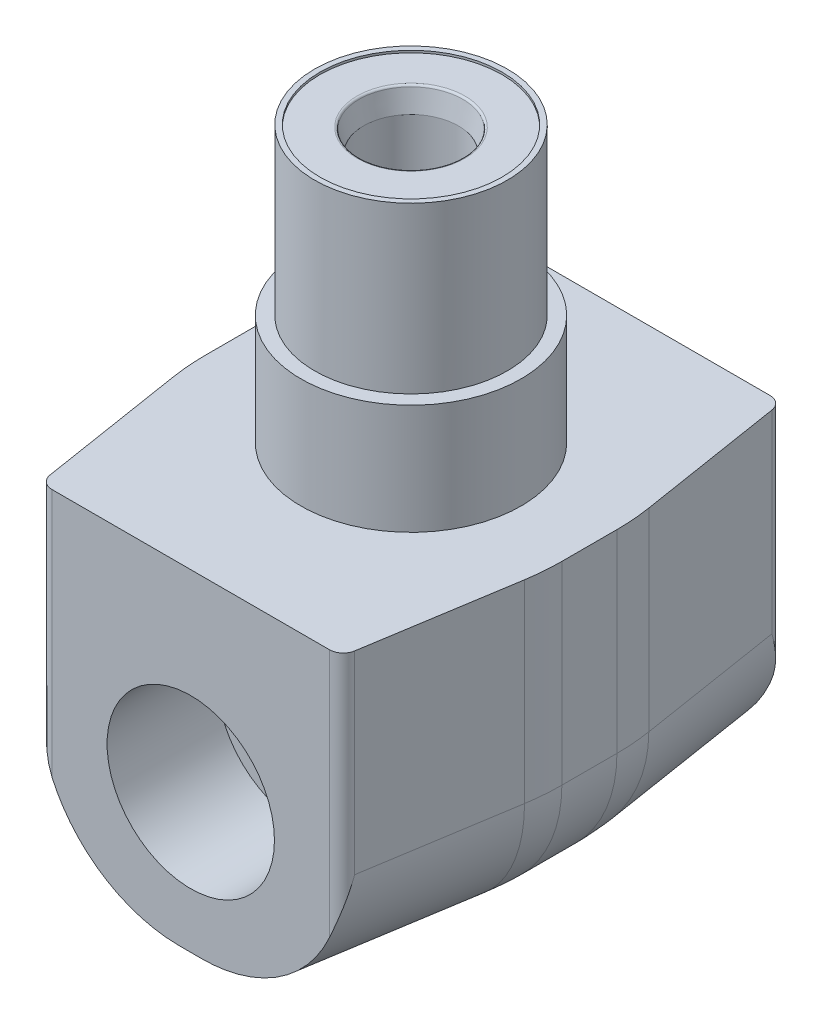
ISO-10303-21;
HEADER;
FILE_DESCRIPTION(('STEP AP214'),'2;1');
FILE_NAME('part.step','',(''),(''),'','','');
FILE_SCHEMA(('AUTOMOTIVE_DESIGN { 1 0 10303 214 1 1 1 1 }'));
ENDSEC;
DATA;
#1=APPLICATION_CONTEXT('core data for automotive mechanical design processes');
#2=APPLICATION_PROTOCOL_DEFINITION('international standard','automotive_design',2000,#1);
#3=PRODUCT_CONTEXT('',#1,'mechanical');
#4=PRODUCT('Part','Part','',(#3));
#5=PRODUCT_RELATED_PRODUCT_CATEGORY('part','',(#4));
#6=PRODUCT_DEFINITION_FORMATION('','',#4);
#7=PRODUCT_DEFINITION_CONTEXT('part definition',#1,'design');
#8=PRODUCT_DEFINITION('design','',#6,#7);
#9=PRODUCT_DEFINITION_SHAPE('','',#8);
#10=(LENGTH_UNIT() NAMED_UNIT(*) SI_UNIT(.MILLI.,.METRE.));
#11=(NAMED_UNIT(*) PLANE_ANGLE_UNIT() SI_UNIT($,.RADIAN.));
#12=(NAMED_UNIT(*) SI_UNIT($,.STERADIAN.) SOLID_ANGLE_UNIT());
#13=UNCERTAINTY_MEASURE_WITH_UNIT(LENGTH_MEASURE(1.E-05),#10,'distance_accuracy_value','');
#14=(GEOMETRIC_REPRESENTATION_CONTEXT(3) GLOBAL_UNCERTAINTY_ASSIGNED_CONTEXT((#13)) GLOBAL_UNIT_ASSIGNED_CONTEXT((#10,
#11,#12)) REPRESENTATION_CONTEXT('',''));
#15=CARTESIAN_POINT('',(0.,0.,0.));
#16=DIRECTION('',(0.,0.,1.));
#17=DIRECTION('',(1.,0.,0.));
#18=AXIS2_PLACEMENT_3D('',#15,#16,#17);
#19=CARTESIAN_POINT('',(-25.4,22.225,25.4));
#20=DIRECTION('',(0.,-1.,0.));
#21=DIRECTION('',(0.,0.,-1.));
#22=AXIS2_PLACEMENT_3D('',#19,#20,#21);
#23=PLANE('',#22);
#24=CARTESIAN_POINT('',(0.,22.225,0.));
#25=DIRECTION('',(0.,-1.,0.));
#26=DIRECTION('',(0.,0.,-1.));
#27=AXIS2_PLACEMENT_3D('',#24,#25,#26);
#28=CIRCLE('',#27,12.7);
#29=CARTESIAN_POINT('',(0.,22.225,-12.7));
#30=VERTEX_POINT('',#29);
#31=EDGE_CURVE('E345',#30,#30,#28,.F.);
#32=ORIENTED_EDGE('',*,*,#31,.F.);
#33=EDGE_LOOP('',(#32));
#34=FACE_BOUND('',#33,.T.);
#35=CARTESIAN_POINT('',(16.002,22.225,-23.8125));
#36=DIRECTION('',(0.,1.,0.));
#37=DIRECTION('',(0.,0.,-1.));
#38=AXIS2_PLACEMENT_3D('',#35,#36,#37);
#39=CIRCLE('',#38,1.5875);
#40=CARTESIAN_POINT('',(17.5697733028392,22.225,-24.0619857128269));
#41=VERTEX_POINT('',#40);
#42=CARTESIAN_POINT('',(16.002,22.225,-25.4));
#43=VERTEX_POINT('',#42);
#44=EDGE_CURVE('E218',#41,#43,#39,.T.);
#45=ORIENTED_EDGE('',*,*,#44,.T.);
#46=DIRECTION('',(-1.,0.,0.));
#47=VECTOR('',#46,1.);
#48=CARTESIAN_POINT('',(-25.4,22.225,-25.4));
#49=LINE('',#48,#47);
#50=CARTESIAN_POINT('',(-16.002,22.225,-25.4));
#51=VERTEX_POINT('',#50);
#52=EDGE_CURVE('E348',#43,#51,#49,.T.);
#53=ORIENTED_EDGE('',*,*,#52,.T.);
#54=CARTESIAN_POINT('',(-16.002,22.225,-23.8125));
#55=DIRECTION('',(0.,-1.,0.));
#56=DIRECTION('',(0.,0.,-1.));
#57=AXIS2_PLACEMENT_3D('',#54,#55,#56);
#58=CIRCLE('',#57,1.5875);
#59=CARTESIAN_POINT('',(-17.5697733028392,22.225,-24.0619857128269));
#60=VERTEX_POINT('',#59);
#61=EDGE_CURVE('E244',#60,#51,#58,.T.);
#62=ORIENTED_EDGE('',*,*,#61,.F.);
#63=DIRECTION('',(0.157156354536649,0.,-0.987573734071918));
#64=VECTOR('',#63,1.);
#65=CARTESIAN_POINT('',(-17.5697733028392,22.225,-24.0619857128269));
#66=LINE('',#65,#64);
#67=CARTESIAN_POINT('',(-20.2583728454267,22.225,-7.1667714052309));
#68=VERTEX_POINT('',#67);
#69=EDGE_CURVE('E273',#68,#60,#66,.T.);
#70=ORIENTED_EDGE('',*,*,#69,.F.);
#71=CARTESIAN_POINT('',(4.82599999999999,22.225,-3.175));
#72=DIRECTION('',(0.,-1.,0.));
#73=DIRECTION('',(0.,0.,1.));
#74=AXIS2_PLACEMENT_3D('',#71,#72,#73);
#75=CIRCLE('',#74,25.4);
#76=CARTESIAN_POINT('',(-20.574,22.225,-3.17500000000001));
#77=VERTEX_POINT('',#76);
#78=EDGE_CURVE('E270',#77,#68,#75,.T.);
#79=ORIENTED_EDGE('',*,*,#78,.F.);
#80=DIRECTION('',(0.,0.,-1.));
#81=VECTOR('',#80,1.);
#82=CARTESIAN_POINT('',(-20.574,22.225,-3.175));
#83=LINE('',#82,#81);
#84=CARTESIAN_POINT('',(-20.574,22.225,3.175));
#85=VERTEX_POINT('',#84);
#86=EDGE_CURVE('E267',#85,#77,#83,.T.);
#87=ORIENTED_EDGE('',*,*,#86,.F.);
#88=CARTESIAN_POINT('',(4.82599999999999,22.225,3.175));
#89=DIRECTION('',(0.,-1.,0.));
#90=DIRECTION('',(0.,0.,-1.));
#91=AXIS2_PLACEMENT_3D('',#88,#89,#90);
#92=CIRCLE('',#91,25.4);
#93=CARTESIAN_POINT('',(-20.2583728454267,22.225,7.1667714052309));
#94=VERTEX_POINT('',#93);
#95=EDGE_CURVE('E264',#94,#85,#92,.T.);
#96=ORIENTED_EDGE('',*,*,#95,.F.);
#97=DIRECTION('',(-0.15715635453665,0.,-0.987573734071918));
#98=VECTOR('',#97,1.);
#99=CARTESIAN_POINT('',(-17.5697733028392,22.225,24.0619857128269));
#100=LINE('',#99,#98);
#101=CARTESIAN_POINT('',(-17.5697733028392,22.225,24.0619857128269));
#102=VERTEX_POINT('',#101);
#103=EDGE_CURVE('E261',#102,#94,#100,.T.);
#104=ORIENTED_EDGE('',*,*,#103,.F.);
#105=CARTESIAN_POINT('',(-16.002,22.225,23.8125));
#106=DIRECTION('',(0.,-1.,0.));
#107=DIRECTION('',(0.,0.,1.));
#108=AXIS2_PLACEMENT_3D('',#105,#106,#107);
#109=CIRCLE('',#108,1.5875);
#110=CARTESIAN_POINT('',(-16.002,22.225,25.4));
#111=VERTEX_POINT('',#110);
#112=EDGE_CURVE('E258',#111,#102,#109,.T.);
#113=ORIENTED_EDGE('',*,*,#112,.F.);
#114=DIRECTION('',(-1.,0.,0.));
#115=VECTOR('',#114,1.);
#116=CARTESIAN_POINT('',(25.4,22.225,25.4));
#117=LINE('',#116,#115);
#118=CARTESIAN_POINT('',(16.002,22.225,25.4));
#119=VERTEX_POINT('',#118);
#120=EDGE_CURVE('E349',#119,#111,#117,.T.);
#121=ORIENTED_EDGE('',*,*,#120,.F.);
#122=CARTESIAN_POINT('',(16.002,22.225,23.8125));
#123=DIRECTION('',(0.,1.,0.));
#124=DIRECTION('',(0.,0.,1.));
#125=AXIS2_PLACEMENT_3D('',#122,#123,#124);
#126=CIRCLE('',#125,1.5875);
#127=CARTESIAN_POINT('',(17.5697733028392,22.225,24.0619857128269));
#128=VERTEX_POINT('',#127);
#129=EDGE_CURVE('E215',#119,#128,#126,.T.);
#130=ORIENTED_EDGE('',*,*,#129,.T.);
#131=DIRECTION('',(0.15715635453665,0.,-0.987573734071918));
#132=VECTOR('',#131,1.);
#133=CARTESIAN_POINT('',(17.5697733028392,22.225,24.0619857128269));
#134=LINE('',#133,#132);
#135=CARTESIAN_POINT('',(20.2583728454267,22.225,7.1667714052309));
#136=VERTEX_POINT('',#135);
#137=EDGE_CURVE('E238',#128,#136,#134,.T.);
#138=ORIENTED_EDGE('',*,*,#137,.T.);
#139=CARTESIAN_POINT('',(-4.82599999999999,22.225,3.175));
#140=DIRECTION('',(0.,1.,0.));
#141=DIRECTION('',(0.,0.,-1.));
#142=AXIS2_PLACEMENT_3D('',#139,#140,#141);
#143=CIRCLE('',#142,25.4);
#144=CARTESIAN_POINT('',(20.574,22.225,3.175));
#145=VERTEX_POINT('',#144);
#146=EDGE_CURVE('E235',#136,#145,#143,.T.);
#147=ORIENTED_EDGE('',*,*,#146,.T.);
#148=DIRECTION('',(0.,0.,-1.));
#149=VECTOR('',#148,1.);
#150=CARTESIAN_POINT('',(20.574,22.225,-3.175));
#151=LINE('',#150,#149);
#152=CARTESIAN_POINT('',(20.574,22.225,-3.17500000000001));
#153=VERTEX_POINT('',#152);
#154=EDGE_CURVE('E231',#145,#153,#151,.T.);
#155=ORIENTED_EDGE('',*,*,#154,.T.);
#156=CARTESIAN_POINT('',(-4.82599999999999,22.225,-3.175));
#157=DIRECTION('',(0.,1.,0.));
#158=DIRECTION('',(0.,0.,1.));
#159=AXIS2_PLACEMENT_3D('',#156,#157,#158);
#160=CIRCLE('',#159,25.4);
#161=CARTESIAN_POINT('',(20.2583728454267,22.225,-7.1667714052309));
#162=VERTEX_POINT('',#161);
#163=EDGE_CURVE('E229',#153,#162,#160,.T.);
#164=ORIENTED_EDGE('',*,*,#163,.T.);
#165=DIRECTION('',(-0.157156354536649,0.,-0.987573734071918));
#166=VECTOR('',#165,1.);
#167=CARTESIAN_POINT('',(17.5697733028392,22.225,-24.0619857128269));
#168=LINE('',#167,#166);
#169=EDGE_CURVE('E208',#162,#41,#168,.T.);
#170=ORIENTED_EDGE('',*,*,#169,.T.);
#171=EDGE_LOOP('',(#45,#53,#62,#70,#79,#87,#96,#104,#113,#121,#130,#138,#147,#155,#164,#170));
#172=FACE_BOUND('',#171,.T.);
#173=ADVANCED_FACE('F40',(#34,#172),#23,.F.);
#174=CARTESIAN_POINT('',(-25.4,-16.002,25.4));
#175=DIRECTION('',(0.,1.,0.));
#176=DIRECTION('',(0.,0.,1.));
#177=AXIS2_PLACEMENT_3D('',#174,#175,#176);
#178=PLANE('',#177);
#179=CARTESIAN_POINT('',(-4.82599999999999,-16.002,3.175));
#180=DIRECTION('',(0.,1.,0.));
#181=DIRECTION('',(0.,0.,1.));
#182=AXIS2_PLACEMENT_3D('',#179,#180,#181);
#183=CIRCLE('',#182,9.525);
#184=CARTESIAN_POINT('',(4.69900000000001,-16.002,3.175));
#185=VERTEX_POINT('',#184);
#186=CARTESIAN_POINT('',(4.58063981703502,-16.002,4.67191427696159));
#187=VERTEX_POINT('',#186);
#188=EDGE_CURVE('E421',#185,#187,#183,.F.);
#189=ORIENTED_EDGE('',*,*,#188,.T.);
#190=DIRECTION('',(0.15715635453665,0.,-0.987573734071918));
#191=VECTOR('',#190,1.);
#192=CARTESIAN_POINT('',(1.89204027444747,-16.002,21.5671285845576));
#193=LINE('',#192,#191);
#194=CARTESIAN_POINT('',(1.28210090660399,-16.002,25.4));
#195=VERTEX_POINT('',#194);
#196=EDGE_CURVE('E423',#187,#195,#193,.F.);
#197=ORIENTED_EDGE('',*,*,#196,.T.);
#198=DIRECTION('',(1.,0.,0.));
#199=VECTOR('',#198,1.);
#200=CARTESIAN_POINT('',(-25.4,-16.002,25.4));
#201=LINE('',#200,#199);
#202=CARTESIAN_POINT('',(-1.28210090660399,-16.002,25.4));
#203=VERTEX_POINT('',#202);
#204=EDGE_CURVE('E352',#203,#195,#201,.T.);
#205=ORIENTED_EDGE('',*,*,#204,.F.);
#206=DIRECTION('',(-0.15715635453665,0.,-0.987573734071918));
#207=VECTOR('',#206,1.);
#208=CARTESIAN_POINT('',(-1.87776766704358,-16.002,21.6568179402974));
#209=LINE('',#208,#207);
#210=CARTESIAN_POINT('',(-4.58063981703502,-16.002,4.67191427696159));
#211=VERTEX_POINT('',#210);
#212=EDGE_CURVE('E406',#203,#211,#209,.T.);
#213=ORIENTED_EDGE('',*,*,#212,.T.);
#214=CARTESIAN_POINT('',(4.82599999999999,-16.002,3.175));
#215=DIRECTION('',(0.,1.,0.));
#216=DIRECTION('',(0.,0.,1.));
#217=AXIS2_PLACEMENT_3D('',#214,#215,#216);
#218=CIRCLE('',#217,9.525);
#219=CARTESIAN_POINT('',(-4.69900000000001,-16.002,3.175));
#220=VERTEX_POINT('',#219);
#221=EDGE_CURVE('E404',#211,#220,#218,.F.);
#222=ORIENTED_EDGE('',*,*,#221,.T.);
#223=DIRECTION('',(0.,0.,-1.));
#224=VECTOR('',#223,1.);
#225=CARTESIAN_POINT('',(-4.69900000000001,-16.002,25.4));
#226=LINE('',#225,#224);
#227=CARTESIAN_POINT('',(-4.69900000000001,-16.002,-3.17500000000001));
#228=VERTEX_POINT('',#227);
#229=EDGE_CURVE('E408',#220,#228,#226,.T.);
#230=ORIENTED_EDGE('',*,*,#229,.T.);
#231=CARTESIAN_POINT('',(4.82599999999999,-16.002,-3.175));
#232=DIRECTION('',(0.,1.,0.));
#233=DIRECTION('',(0.,0.,1.));
#234=AXIS2_PLACEMENT_3D('',#231,#232,#233);
#235=CIRCLE('',#234,9.525);
#236=CARTESIAN_POINT('',(-4.58063981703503,-16.002,-4.67191427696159));
#237=VERTEX_POINT('',#236);
#238=EDGE_CURVE('E410',#228,#237,#235,.F.);
#239=ORIENTED_EDGE('',*,*,#238,.T.);
#240=DIRECTION('',(0.15715635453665,0.,-0.987573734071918));
#241=VECTOR('',#240,1.);
#242=CARTESIAN_POINT('',(-9.76210485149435,-16.002,27.8885175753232));
#243=LINE('',#242,#241);
#244=CARTESIAN_POINT('',(-1.28210090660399,-16.002,-25.4));
#245=VERTEX_POINT('',#244);
#246=EDGE_CURVE('E412',#237,#245,#243,.T.);
#247=ORIENTED_EDGE('',*,*,#246,.T.);
#248=DIRECTION('',(1.,0.,0.));
#249=VECTOR('',#248,1.);
#250=CARTESIAN_POINT('',(-25.4,-16.002,-25.4));
#251=LINE('',#250,#249);
#252=CARTESIAN_POINT('',(1.28210090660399,-16.002,-25.4));
#253=VERTEX_POINT('',#252);
#254=EDGE_CURVE('E353',#245,#253,#251,.T.);
#255=ORIENTED_EDGE('',*,*,#254,.T.);
#256=DIRECTION('',(-0.15715635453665,0.,-0.987573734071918));
#257=VECTOR('',#256,1.);
#258=CARTESIAN_POINT('',(4.58063981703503,-16.002,-4.67191427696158));
#259=LINE('',#258,#257);
#260=CARTESIAN_POINT('',(4.58063981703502,-16.002,-4.67191427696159));
#261=VERTEX_POINT('',#260);
#262=EDGE_CURVE('E417',#253,#261,#259,.F.);
#263=ORIENTED_EDGE('',*,*,#262,.T.);
#264=CARTESIAN_POINT('',(-4.82599999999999,-16.002,-3.175));
#265=DIRECTION('',(0.,1.,0.));
#266=DIRECTION('',(0.,0.,1.));
#267=AXIS2_PLACEMENT_3D('',#264,#265,#266);
#268=CIRCLE('',#267,9.525);
#269=CARTESIAN_POINT('',(4.69900000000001,-16.002,-3.17500000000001));
#270=VERTEX_POINT('',#269);
#271=EDGE_CURVE('E415',#261,#270,#268,.F.);
#272=ORIENTED_EDGE('',*,*,#271,.T.);
#273=DIRECTION('',(0.,0.,-1.));
#274=VECTOR('',#273,1.);
#275=CARTESIAN_POINT('',(4.69900000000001,-16.002,3.175));
#276=LINE('',#275,#274);
#277=EDGE_CURVE('E419',#270,#185,#276,.F.);
#278=ORIENTED_EDGE('',*,*,#277,.T.);
#279=EDGE_LOOP('',(#189,#197,#205,#213,#222,#230,#239,#247,#255,#263,#272,#278));
#280=FACE_BOUND('',#279,.T.);
#281=ADVANCED_FACE('F585',(#280),#178,.F.);
#282=CARTESIAN_POINT('',(0.,0.,25.4));
#283=DIRECTION('',(0.,0.,-1.));
#284=DIRECTION('',(-1.,0.,0.));
#285=AXIS2_PLACEMENT_3D('',#282,#283,#284);
#286=PLANE('',#285);
#287=CARTESIAN_POINT('',(0.,0.,25.4));
#288=DIRECTION('',(0.,0.,1.));
#289=DIRECTION('',(1.,0.,0.));
#290=AXIS2_PLACEMENT_3D('',#287,#288,#289);
#291=CIRCLE('',#290,9.652);
#292=CARTESIAN_POINT('',(9.652,0.,25.4));
#293=VERTEX_POINT('',#292);
#294=EDGE_CURVE('E335',#293,#293,#291,.T.);
#295=ORIENTED_EDGE('',*,*,#294,.F.);
#296=EDGE_LOOP('',(#295));
#297=FACE_BOUND('',#296,.T.);
#298=ORIENTED_EDGE('',*,*,#204,.T.);
#299=CARTESIAN_POINT('',(1.28210090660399,-0.126999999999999,25.4));
#300=DIRECTION('',(0.,0.,-1.));
#301=DIRECTION('',(-1.,0.,0.));
#302=AXIS2_PLACEMENT_3D('',#299,#300,#301);
#303=ELLIPSE('',#302,16.0747491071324,15.875);
#304=CARTESIAN_POINT('',(16.002,-6.50600238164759,25.4));
#305=VERTEX_POINT('',#304);
#306=EDGE_CURVE('E427',#195,#305,#303,.F.);
#307=ORIENTED_EDGE('',*,*,#306,.T.);
#308=DIRECTION('',(0.,1.,0.));
#309=VECTOR('',#308,1.);
#310=CARTESIAN_POINT('',(16.002,-16.002,25.4));
#311=LINE('',#310,#309);
#312=EDGE_CURVE('E245',#305,#119,#311,.T.);
#313=ORIENTED_EDGE('',*,*,#312,.T.);
#314=ORIENTED_EDGE('',*,*,#120,.T.);
#315=DIRECTION('',(0.,1.,0.));
#316=VECTOR('',#315,1.);
#317=CARTESIAN_POINT('',(-16.002,-16.002,25.4));
#318=LINE('',#317,#316);
#319=CARTESIAN_POINT('',(-16.002,-6.50600238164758,25.4));
#320=VERTEX_POINT('',#319);
#321=EDGE_CURVE('E290',#320,#111,#318,.T.);
#322=ORIENTED_EDGE('',*,*,#321,.F.);
#323=CARTESIAN_POINT('',(-1.28210090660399,-0.126999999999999,25.4));
#324=DIRECTION('',(0.,0.,-1.));
#325=DIRECTION('',(-1.,0.,0.));
#326=AXIS2_PLACEMENT_3D('',#323,#324,#325);
#327=ELLIPSE('',#326,16.0747491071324,15.875);
#328=EDGE_CURVE('E425',#320,#203,#327,.F.);
#329=ORIENTED_EDGE('',*,*,#328,.T.);
#330=EDGE_LOOP('',(#298,#307,#313,#314,#322,#329));
#331=FACE_BOUND('',#330,.T.);
#332=ADVANCED_FACE('F591',(#297,#331),#286,.F.);
#333=CARTESIAN_POINT('',(0.,0.,-25.4));
#334=DIRECTION('',(0.,0.,-1.));
#335=DIRECTION('',(-1.,0.,0.));
#336=AXIS2_PLACEMENT_3D('',#333,#334,#335);
#337=PLANE('',#336);
#338=DIRECTION('',(0.,1.,0.));
#339=VECTOR('',#338,1.);
#340=CARTESIAN_POINT('',(16.002,-16.002,-25.4));
#341=LINE('',#340,#339);
#342=CARTESIAN_POINT('',(16.002,-6.50600238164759,-25.4));
#343=VERTEX_POINT('',#342);
#344=EDGE_CURVE('E221',#343,#43,#341,.T.);
#345=ORIENTED_EDGE('',*,*,#344,.F.);
#346=CARTESIAN_POINT('',(1.28210090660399,-0.126999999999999,-25.4));
#347=DIRECTION('',(0.,0.,-1.));
#348=DIRECTION('',(1.,0.,0.));
#349=AXIS2_PLACEMENT_3D('',#346,#347,#348);
#350=ELLIPSE('',#349,16.0747491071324,15.875);
#351=EDGE_CURVE('E553',#343,#253,#350,.T.);
#352=ORIENTED_EDGE('',*,*,#351,.T.);
#353=ORIENTED_EDGE('',*,*,#254,.F.);
#354=CARTESIAN_POINT('',(-1.282100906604,-0.126999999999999,-25.4));
#355=DIRECTION('',(0.,0.,-1.));
#356=DIRECTION('',(1.,0.,0.));
#357=AXIS2_PLACEMENT_3D('',#354,#355,#356);
#358=ELLIPSE('',#357,16.0747491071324,15.875);
#359=CARTESIAN_POINT('',(-16.002,-6.50600238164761,-25.4));
#360=VERTEX_POINT('',#359);
#361=EDGE_CURVE('E477',#245,#360,#358,.T.);
#362=ORIENTED_EDGE('',*,*,#361,.T.);
#363=DIRECTION('',(0.,1.,0.));
#364=VECTOR('',#363,1.);
#365=CARTESIAN_POINT('',(-16.002,-16.002,-25.4));
#366=LINE('',#365,#364);
#367=EDGE_CURVE('E276',#360,#51,#366,.T.);
#368=ORIENTED_EDGE('',*,*,#367,.T.);
#369=ORIENTED_EDGE('',*,*,#52,.F.);
#370=EDGE_LOOP('',(#345,#352,#353,#362,#368,#369));
#371=FACE_BOUND('',#370,.T.);
#372=CARTESIAN_POINT('',(0.,0.,-25.4));
#373=DIRECTION('',(0.,0.,1.));
#374=DIRECTION('',(1.,0.,0.));
#375=AXIS2_PLACEMENT_3D('',#372,#373,#374);
#376=CIRCLE('',#375,9.65199999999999);
#377=CARTESIAN_POINT('',(9.65199999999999,0.,-25.4));
#378=VERTEX_POINT('',#377);
#379=EDGE_CURVE('E320',#378,#378,#376,.T.);
#380=ORIENTED_EDGE('',*,*,#379,.T.);
#381=EDGE_LOOP('',(#380));
#382=FACE_BOUND('',#381,.T.);
#383=ADVANCED_FACE('F558',(#371,#382),#337,.T.);
#384=CARTESIAN_POINT('',(0.,-44.6369966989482,0.));
#385=DIRECTION('',(0.,1.,0.));
#386=DIRECTION('',(-1.,0.,0.));
#387=AXIS2_PLACEMENT_3D('',#384,#385,#386);
#388=CYLINDRICAL_SURFACE('',#387,12.7);
#389=CARTESIAN_POINT('',(0.,34.925,0.));
#390=DIRECTION('',(0.,-1.,0.));
#391=DIRECTION('',(0.,0.,-1.));
#392=AXIS2_PLACEMENT_3D('',#389,#390,#391);
#393=CIRCLE('',#392,12.7);
#394=CARTESIAN_POINT('',(0.,34.925,-12.7));
#395=VERTEX_POINT('',#394);
#396=EDGE_CURVE('E344',#395,#395,#393,.F.);
#397=ORIENTED_EDGE('',*,*,#396,.F.);
#398=EDGE_LOOP('',(#397));
#399=FACE_BOUND('',#398,.T.);
#400=ORIENTED_EDGE('',*,*,#31,.T.);
#401=EDGE_LOOP('',(#400));
#402=FACE_BOUND('',#401,.T.);
#403=ADVANCED_FACE('F640',(#399,#402),#388,.T.);
#404=CARTESIAN_POINT('',(0.,-28.8778506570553,0.));
#405=DIRECTION('',(0.,1.,0.));
#406=DIRECTION('',(-1.,0.,0.));
#407=AXIS2_PLACEMENT_3D('',#404,#405,#406);
#408=CYLINDRICAL_SURFACE('',#407,11.1125);
#409=CARTESIAN_POINT('',(0.,53.975,0.));
#410=DIRECTION('',(0.,1.,0.));
#411=DIRECTION('',(-1.,0.,0.));
#412=AXIS2_PLACEMENT_3D('',#409,#410,#411);
#413=CIRCLE('',#412,11.1125);
#414=CARTESIAN_POINT('',(-11.1125,53.975,0.));
#415=VERTEX_POINT('',#414);
#416=EDGE_CURVE('E338',#415,#415,#413,.T.);
#417=ORIENTED_EDGE('',*,*,#416,.F.);
#418=EDGE_LOOP('',(#417));
#419=FACE_BOUND('',#418,.T.);
#420=CARTESIAN_POINT('',(0.,34.925,0.));
#421=DIRECTION('',(0.,-1.,0.));
#422=DIRECTION('',(0.,0.,-1.));
#423=AXIS2_PLACEMENT_3D('',#420,#421,#422);
#424=CIRCLE('',#423,11.1125);
#425=CARTESIAN_POINT('',(0.,34.925,-11.1125));
#426=VERTEX_POINT('',#425);
#427=EDGE_CURVE('E341',#426,#426,#424,.F.);
#428=ORIENTED_EDGE('',*,*,#427,.T.);
#429=EDGE_LOOP('',(#428));
#430=FACE_BOUND('',#429,.T.);
#431=ADVANCED_FACE('F646',(#419,#430),#408,.T.);
#432=CARTESIAN_POINT('',(-25.4,34.925,25.4));
#433=DIRECTION('',(0.,-1.,0.));
#434=DIRECTION('',(0.,0.,-1.));
#435=AXIS2_PLACEMENT_3D('',#432,#433,#434);
#436=PLANE('',#435);
#437=ORIENTED_EDGE('',*,*,#396,.T.);
#438=EDGE_LOOP('',(#437));
#439=FACE_BOUND('',#438,.T.);
#440=ORIENTED_EDGE('',*,*,#427,.F.);
#441=EDGE_LOOP('',(#440));
#442=FACE_BOUND('',#441,.T.);
#443=ADVANCED_FACE('F648',(#439,#442),#436,.F.);
#444=CARTESIAN_POINT('',(-12.7,53.975,25.4));
#445=DIRECTION('',(0.,-1.,0.));
#446=DIRECTION('',(0.,0.,-1.));
#447=AXIS2_PLACEMENT_3D('',#444,#445,#446);
#448=PLANE('',#447);
#449=CARTESIAN_POINT('',(0.,53.975,0.));
#450=DIRECTION('',(0.,1.,0.));
#451=DIRECTION('',(0.,0.,1.));
#452=AXIS2_PLACEMENT_3D('',#449,#450,#451);
#453=CIRCLE('',#452,10.5);
#454=CARTESIAN_POINT('',(0.,53.975,10.5));
#455=VERTEX_POINT('',#454);
#456=EDGE_CURVE('E317',#455,#455,#453,.T.);
#457=ORIENTED_EDGE('',*,*,#456,.F.);
#458=EDGE_LOOP('',(#457));
#459=FACE_BOUND('',#458,.T.);
#460=ORIENTED_EDGE('',*,*,#416,.T.);
#461=EDGE_LOOP('',(#460));
#462=FACE_BOUND('',#461,.T.);
#463=ADVANCED_FACE('F448',(#459,#462),#448,.F.);
#464=CARTESIAN_POINT('',(0.,0.,0.));
#465=DIRECTION('',(0.,0.,1.));
#466=DIRECTION('',(1.,0.,0.));
#467=AXIS2_PLACEMENT_3D('',#464,#465,#466);
#468=CYLINDRICAL_SURFACE('',#467,9.652);
#469=ORIENTED_EDGE('',*,*,#294,.T.);
#470=EDGE_LOOP('',(#469));
#471=FACE_BOUND('',#470,.T.);
#472=CARTESIAN_POINT('',(0.,0.,12.7));
#473=DIRECTION('',(0.,0.,1.));
#474=DIRECTION('',(1.,0.,0.));
#475=AXIS2_PLACEMENT_3D('',#472,#473,#474);
#476=CIRCLE('',#475,9.65199999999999);
#477=CARTESIAN_POINT('',(9.652,0.,12.7));
#478=VERTEX_POINT('',#477);
#479=EDGE_CURVE('E332',#478,#478,#476,.T.);
#480=ORIENTED_EDGE('',*,*,#479,.F.);
#481=EDGE_LOOP('',(#480));
#482=FACE_BOUND('',#481,.T.);
#483=ADVANCED_FACE('F655',(#471,#482),#468,.F.);
#484=CARTESIAN_POINT('',(-9.65199999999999,0.,12.7));
#485=DIRECTION('',(0.,0.,1.));
#486=DIRECTION('',(1.,0.,0.));
#487=AXIS2_PLACEMENT_3D('',#484,#485,#486);
#488=PLANE('',#487);
#489=ORIENTED_EDGE('',*,*,#479,.T.);
#490=EDGE_LOOP('',(#489));
#491=FACE_BOUND('',#490,.T.);
#492=CARTESIAN_POINT('',(0.,0.,12.7));
#493=DIRECTION('',(0.,0.,1.));
#494=DIRECTION('',(1.,0.,0.));
#495=AXIS2_PLACEMENT_3D('',#492,#493,#494);
#496=CIRCLE('',#495,7.11199999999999);
#497=CARTESIAN_POINT('',(7.112,0.,12.7));
#498=VERTEX_POINT('',#497);
#499=EDGE_CURVE('E329',#498,#498,#496,.T.);
#500=ORIENTED_EDGE('',*,*,#499,.F.);
#501=EDGE_LOOP('',(#500));
#502=FACE_BOUND('',#501,.T.);
#503=ADVANCED_FACE('F657',(#491,#502),#488,.T.);
#504=CARTESIAN_POINT('',(0.,0.,0.));
#505=DIRECTION('',(0.,0.,1.));
#506=DIRECTION('',(1.,0.,0.));
#507=AXIS2_PLACEMENT_3D('',#504,#505,#506);
#508=CYLINDRICAL_SURFACE('',#507,7.11199999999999);
#509=CARTESIAN_POINT('',(2.98791734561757,6.45390532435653,-4.56632905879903));
#510=CARTESIAN_POINT('',(3.04367062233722,6.42808935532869,-4.47849451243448));
#511=CARTESIAN_POINT('',(3.09731626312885,6.40238067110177,-4.38931930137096));
#512=CARTESIAN_POINT('',(3.2005472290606,6.35140666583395,-4.20854738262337));
#513=CARTESIAN_POINT('',(3.25013332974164,6.32614126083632,-4.11695114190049));
#514=CARTESIAN_POINT('',(3.39299600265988,6.25137452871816,-3.83900426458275));
#515=CARTESIAN_POINT('',(3.48045769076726,6.20286442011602,-3.64936679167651));
#516=CARTESIAN_POINT('',(3.64082636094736,6.11011610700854,-3.26253616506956));
#517=CARTESIAN_POINT('',(3.71369916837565,6.06588805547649,-3.0653265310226));
#518=CARTESIAN_POINT('',(3.84510078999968,5.98345712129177,-2.66490215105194));
#519=CARTESIAN_POINT('',(3.90362634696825,5.94525560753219,-2.46168605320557));
#520=CARTESIAN_POINT('',(4.00828159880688,5.87523059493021,-2.0429994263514));
#521=CARTESIAN_POINT('',(4.05388912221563,5.84368625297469,-1.82735111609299));
#522=CARTESIAN_POINT('',(4.12970526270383,5.79035685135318,-1.39218441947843));
#523=CARTESIAN_POINT('',(4.15991556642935,5.76857072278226,-1.17266645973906));
#524=CARTESIAN_POINT('',(4.20471620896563,5.73599842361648,-0.731555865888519));
#525=CARTESIAN_POINT('',(4.21933006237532,5.72519569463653,-0.509966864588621));
#526=CARTESIAN_POINT('',(4.23288093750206,5.71518477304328,-0.0660467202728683));
#527=CARTESIAN_POINT('',(4.23181823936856,5.71597637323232,0.156284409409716));
#528=CARTESIAN_POINT('',(4.21414639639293,5.72901631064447,0.597022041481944));
#529=CARTESIAN_POINT('',(4.19774380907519,5.74111242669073,0.815441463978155));
#530=CARTESIAN_POINT('',(4.14983095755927,5.77583905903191,1.2497750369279));
#531=CARTESIAN_POINT('',(4.11831958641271,5.79847034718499,1.46568900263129));
#532=CARTESIAN_POINT('',(4.04033465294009,5.85307620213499,1.89380388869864));
#533=CARTESIAN_POINT('',(3.99384614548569,5.88506009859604,2.10600087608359));
#534=CARTESIAN_POINT('',(3.88599950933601,5.95682355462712,2.52521578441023));
#535=CARTESIAN_POINT('',(3.82464306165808,5.99660223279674,2.73223428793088));
#536=CARTESIAN_POINT('',(3.70720869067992,6.06963014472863,3.07979808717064));
#537=CARTESIAN_POINT('',(3.65490327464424,6.10134923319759,3.22195495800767));
#538=CARTESIAN_POINT('',(3.54266411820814,6.16719589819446,3.50260853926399));
#539=CARTESIAN_POINT('',(3.48273287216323,6.20132268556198,3.64110642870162));
#540=CARTESIAN_POINT('',(3.35517050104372,6.27125737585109,3.91354413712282));
#541=CARTESIAN_POINT('',(3.2875634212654,6.3070598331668,4.04749657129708));
#542=CARTESIAN_POINT('',(3.14405720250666,6.37980077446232,4.31066407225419));
#543=CARTESIAN_POINT('',(3.06815323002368,6.41673991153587,4.43987631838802));
#544=CARTESIAN_POINT('',(2.98791734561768,6.45390532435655,4.56632905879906));
#545=B_SPLINE_CURVE_WITH_KNOTS('',3,(#509,#510,#511,#512,#513,#514,#515,#516,#517,#518,#519,
#520,#521,#522,#523,#524,#525,#526,#527,#528,#529,#530,#531,#532,#533,#534,#535,#536,#537,#538,
#539,#540,#541,#542,#543,#544),.UNSPECIFIED.,.F.,.F.,(4,2,2,2,2,2,2,2,2,2,2,2,2,2,2,2,2,4),(0.,
0.321501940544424,0.642942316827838,1.28535465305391,1.92925467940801,2.57330075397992,
3.24053525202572,3.90769664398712,4.57385073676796,5.23999292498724,5.89729245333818,
6.55464014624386,7.2126458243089,7.87057714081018,8.33462892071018,8.79852930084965,
9.26101460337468,9.72377078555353),.UNSPECIFIED.);
#546=CARTESIAN_POINT('',(3.56210967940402,6.15564120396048,-3.4524086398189));
#547=VERTEX_POINT('',#546);
#548=CARTESIAN_POINT('',(3.56210967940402,6.15564120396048,3.4524086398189));
#549=VERTEX_POINT('',#548);
#550=EDGE_CURVE('E392',#547,#549,#545,.T.);
#551=ORIENTED_EDGE('',*,*,#550,.F.);
#552=CARTESIAN_POINT('',(-3.56210967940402,6.15564120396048,-3.4524086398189));
#553=CARTESIAN_POINT('',(-3.46988096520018,6.20902272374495,-3.54755589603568));
#554=CARTESIAN_POINT('',(-3.37369076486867,6.26190751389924,-3.63918426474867));
#555=CARTESIAN_POINT('',(-3.17356025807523,6.36566865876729,-3.81497613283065));
#556=CARTESIAN_POINT('',(-3.06961399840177,6.41654342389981,-3.89913378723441));
#557=CARTESIAN_POINT('',(-2.85336943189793,6.51560428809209,-4.06009177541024));
#558=CARTESIAN_POINT('',(-2.74100742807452,6.56376374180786,-4.13682320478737));
#559=CARTESIAN_POINT('',(-2.50911147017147,6.65585908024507,-4.28144589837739));
#560=CARTESIAN_POINT('',(-2.38957904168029,6.69979585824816,-4.3493390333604));
#561=CARTESIAN_POINT('',(-2.14313467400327,6.78266248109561,-4.4759377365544));
#562=CARTESIAN_POINT('',(-2.01618500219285,6.82156276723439,-4.53458946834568));
#563=CARTESIAN_POINT('',(-1.75625892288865,6.89305873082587,-4.64144834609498));
#564=CARTESIAN_POINT('',(-1.62328347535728,6.92565540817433,-4.68965714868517));
#565=CARTESIAN_POINT('',(-1.35276010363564,6.98352648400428,-4.77470590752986));
#566=CARTESIAN_POINT('',(-1.21523139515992,7.00882813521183,-4.81158821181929));
#567=CARTESIAN_POINT('',(-0.936340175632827,7.05150314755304,-4.87354177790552));
#568=CARTESIAN_POINT('',(-0.794978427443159,7.06887807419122,-4.89861537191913));
#569=CARTESIAN_POINT('',(-0.528460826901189,7.09343213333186,-4.93397643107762));
#570=CARTESIAN_POINT('',(-0.403597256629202,7.10164584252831,-4.94576636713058));
#571=CARTESIAN_POINT('',(-0.153081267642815,7.11145674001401,-4.9598437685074));
#572=CARTESIAN_POINT('',(-0.0274289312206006,7.11305460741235,-4.96213220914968));
#573=CARTESIAN_POINT('',(0.223646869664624,7.10959192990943,-4.95716724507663));
#574=CARTESIAN_POINT('',(0.349070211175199,7.10452849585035,-4.94990970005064));
#575=CARTESIAN_POINT('',(0.598569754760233,7.08786927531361,-4.92596907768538));
#576=CARTESIAN_POINT('',(0.722645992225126,7.07627366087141,-4.90928624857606));
#577=CARTESIAN_POINT('',(0.958063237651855,7.04808480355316,-4.86856274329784));
#578=CARTESIAN_POINT('',(1.06959412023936,7.03199692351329,-4.8452633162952));
#579=CARTESIAN_POINT('',(1.29003603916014,6.99491726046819,-4.79128942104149));
#580=CARTESIAN_POINT('',(1.39894624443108,6.97392394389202,-4.7606126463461));
#581=CARTESIAN_POINT('',(1.72079694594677,6.90416261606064,-4.65802726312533));
#582=CARTESIAN_POINT('',(1.92900720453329,6.848594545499,-4.57553714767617));
#583=CARTESIAN_POINT('',(2.34514069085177,6.71806120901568,-4.37784263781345));
#584=CARTESIAN_POINT('',(2.55165448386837,6.64188324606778,-4.2605182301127));
#585=CARTESIAN_POINT('',(2.9427465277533,6.47809135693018,-4.00038733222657));
#586=CARTESIAN_POINT('',(3.12733732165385,6.39048403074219,-3.85759553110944));
#587=CARTESIAN_POINT('',(3.34542894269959,6.27624745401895,-3.66326973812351));
#588=CARTESIAN_POINT('',(3.38994134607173,6.25230672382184,-3.62211539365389));
#589=CARTESIAN_POINT('',(3.47727267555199,6.20415937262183,-3.53835768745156));
#590=CARTESIAN_POINT('',(3.52009422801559,6.1799532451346,-3.49575678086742));
#591=CARTESIAN_POINT('',(3.56210967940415,6.15564120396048,-3.45240863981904));
#592=B_SPLINE_CURVE_WITH_KNOTS('',3,(#552,#553,#554,#555,#556,#557,#558,#559,#560,#561,#562,
#563,#564,#565,#566,#567,#568,#569,#570,#571,#572,#573,#574,#575,#576,#577,#578,#579,#580,#581,
#582,#583,#584,#585,#586,#587,#588,#589,#590,#591),.UNSPECIFIED.,.F.,.F.,(4,2,2,2,2,2,2,2,2,2,2,
2,2,2,2,2,2,2,2,4),(0.,0.428521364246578,0.857375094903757,1.28988807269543,1.72230935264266,
2.15716335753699,2.59194832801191,3.02508733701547,3.45814076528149,3.83468646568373,
4.21119351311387,4.58786391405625,4.96452439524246,5.30934257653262,5.65426870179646,
6.34366667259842,7.08931212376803,7.8345288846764,8.03004260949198,8.22523963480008),.UNSPECIFIED.);
#593=CARTESIAN_POINT('',(-3.56210967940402,6.15564120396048,-3.4524086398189));
#594=VERTEX_POINT('',#593);
#595=EDGE_CURVE('E398',#594,#547,#592,.T.);
#596=ORIENTED_EDGE('',*,*,#595,.F.);
#597=CARTESIAN_POINT('',(-2.98791734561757,6.45390532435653,4.56632905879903));
#598=CARTESIAN_POINT('',(-3.04367062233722,6.42808935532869,4.47849451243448));
#599=CARTESIAN_POINT('',(-3.09731626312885,6.40238067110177,4.38931930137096));
#600=CARTESIAN_POINT('',(-3.20054722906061,6.35140666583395,4.20854738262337));
#601=CARTESIAN_POINT('',(-3.25013332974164,6.32614126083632,4.11695114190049));
#602=CARTESIAN_POINT('',(-3.39299600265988,6.25137452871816,3.83900426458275));
#603=CARTESIAN_POINT('',(-3.48045769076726,6.20286442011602,3.64936679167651));
#604=CARTESIAN_POINT('',(-3.64082636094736,6.11011610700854,3.26253616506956));
#605=CARTESIAN_POINT('',(-3.71369916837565,6.06588805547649,3.0653265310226));
#606=CARTESIAN_POINT('',(-3.84510078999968,5.98345712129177,2.66490215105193));
#607=CARTESIAN_POINT('',(-3.90362634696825,5.94525560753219,2.46168605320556));
#608=CARTESIAN_POINT('',(-4.00828159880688,5.87523059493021,2.0429994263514));
#609=CARTESIAN_POINT('',(-4.05388912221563,5.84368625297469,1.82735111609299));
#610=CARTESIAN_POINT('',(-4.12970526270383,5.79035685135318,1.39218441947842));
#611=CARTESIAN_POINT('',(-4.15991556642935,5.76857072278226,1.17266645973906));
#612=CARTESIAN_POINT('',(-4.20471620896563,5.73599842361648,0.731555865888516));
#613=CARTESIAN_POINT('',(-4.21933006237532,5.72519569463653,0.509966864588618));
#614=CARTESIAN_POINT('',(-4.23288093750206,5.71518477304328,0.0660467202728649));
#615=CARTESIAN_POINT('',(-4.23181823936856,5.71597637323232,-0.156284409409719));
#616=CARTESIAN_POINT('',(-4.21414639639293,5.72901631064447,-0.597022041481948));
#617=CARTESIAN_POINT('',(-4.19774380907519,5.74111242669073,-0.815441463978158));
#618=CARTESIAN_POINT('',(-4.14983095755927,5.77583905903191,-1.24977503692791));
#619=CARTESIAN_POINT('',(-4.11831958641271,5.79847034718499,-1.4656890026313));
#620=CARTESIAN_POINT('',(-4.04033465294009,5.85307620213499,-1.89380388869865));
#621=CARTESIAN_POINT('',(-3.99384614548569,5.88506009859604,-2.10600087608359));
#622=CARTESIAN_POINT('',(-3.88599950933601,5.95682355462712,-2.52521578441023));
#623=CARTESIAN_POINT('',(-3.82464306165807,5.99660223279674,-2.73223428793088));
#624=CARTESIAN_POINT('',(-3.70720869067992,6.06963014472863,-3.07979808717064));
#625=CARTESIAN_POINT('',(-3.65490327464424,6.10134923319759,-3.22195495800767));
#626=CARTESIAN_POINT('',(-3.54266411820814,6.16719589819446,-3.50260853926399));
#627=CARTESIAN_POINT('',(-3.48273287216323,6.20132268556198,-3.64110642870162));
#628=CARTESIAN_POINT('',(-3.35517050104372,6.27125737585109,-3.91354413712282));
#629=CARTESIAN_POINT('',(-3.2875634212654,6.3070598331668,-4.04749657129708));
#630=CARTESIAN_POINT('',(-3.14405720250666,6.37980077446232,-4.31066407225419));
#631=CARTESIAN_POINT('',(-3.06815323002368,6.41673991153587,-4.43987631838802));
#632=CARTESIAN_POINT('',(-2.98791734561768,6.45390532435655,-4.56632905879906));
#633=B_SPLINE_CURVE_WITH_KNOTS('',3,(#597,#598,#599,#600,#601,#602,#603,#604,#605,#606,#607,
#608,#609,#610,#611,#612,#613,#614,#615,#616,#617,#618,#619,#620,#621,#622,#623,#624,#625,#626,
#627,#628,#629,#630,#631,#632),.UNSPECIFIED.,.F.,.F.,(4,2,2,2,2,2,2,2,2,2,2,2,2,2,2,2,2,4),(0.,
0.321501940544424,0.642942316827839,1.28535465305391,1.92925467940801,2.57330075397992,
3.24053525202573,3.90769664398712,4.57385073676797,5.23999292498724,5.89729245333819,
6.55464014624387,7.2126458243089,7.87057714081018,8.33462892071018,8.79852930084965,
9.26101460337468,9.72377078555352),.UNSPECIFIED.);
#634=CARTESIAN_POINT('',(-3.56210967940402,6.15564120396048,3.4524086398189));
#635=VERTEX_POINT('',#634);
#636=EDGE_CURVE('E356',#635,#594,#633,.T.);
#637=ORIENTED_EDGE('',*,*,#636,.F.);
#638=CARTESIAN_POINT('',(3.56210967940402,6.15564120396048,3.4524086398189));
#639=CARTESIAN_POINT('',(3.46988096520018,6.20902272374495,3.54755589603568));
#640=CARTESIAN_POINT('',(3.37369076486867,6.26190751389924,3.63918426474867));
#641=CARTESIAN_POINT('',(3.17356025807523,6.36566865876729,3.81497613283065));
#642=CARTESIAN_POINT('',(3.06961399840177,6.41654342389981,3.89913378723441));
#643=CARTESIAN_POINT('',(2.85336943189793,6.51560428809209,4.06009177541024));
#644=CARTESIAN_POINT('',(2.74100742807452,6.56376374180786,4.13682320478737));
#645=CARTESIAN_POINT('',(2.50911147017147,6.65585908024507,4.28144589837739));
#646=CARTESIAN_POINT('',(2.38957904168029,6.69979585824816,4.3493390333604));
#647=CARTESIAN_POINT('',(2.14313467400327,6.78266248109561,4.4759377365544));
#648=CARTESIAN_POINT('',(2.01618500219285,6.82156276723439,4.53458946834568));
#649=CARTESIAN_POINT('',(1.75625892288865,6.89305873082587,4.64144834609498));
#650=CARTESIAN_POINT('',(1.62328347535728,6.92565540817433,4.68965714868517));
#651=CARTESIAN_POINT('',(1.35276010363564,6.98352648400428,4.77470590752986));
#652=CARTESIAN_POINT('',(1.21523139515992,7.00882813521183,4.81158821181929));
#653=CARTESIAN_POINT('',(0.936340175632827,7.05150314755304,4.87354177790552));
#654=CARTESIAN_POINT('',(0.794978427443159,7.06887807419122,4.89861537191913));
#655=CARTESIAN_POINT('',(0.528460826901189,7.09343213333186,4.93397643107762));
#656=CARTESIAN_POINT('',(0.403597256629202,7.10164584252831,4.94576636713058));
#657=CARTESIAN_POINT('',(0.153081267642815,7.11145674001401,4.9598437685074));
#658=CARTESIAN_POINT('',(0.0274289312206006,7.11305460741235,4.96213220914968));
#659=CARTESIAN_POINT('',(-0.223646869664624,7.10959192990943,4.95716724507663));
#660=CARTESIAN_POINT('',(-0.349070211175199,7.10452849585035,4.94990970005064));
#661=CARTESIAN_POINT('',(-0.598569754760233,7.08786927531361,4.92596907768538));
#662=CARTESIAN_POINT('',(-0.722645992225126,7.07627366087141,4.90928624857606));
#663=CARTESIAN_POINT('',(-0.958063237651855,7.04808480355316,4.86856274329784));
#664=CARTESIAN_POINT('',(-1.06959412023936,7.03199692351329,4.8452633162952));
#665=CARTESIAN_POINT('',(-1.29003603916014,6.99491726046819,4.79128942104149));
#666=CARTESIAN_POINT('',(-1.39894624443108,6.97392394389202,4.7606126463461));
#667=CARTESIAN_POINT('',(-1.72079694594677,6.90416261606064,4.65802726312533));
#668=CARTESIAN_POINT('',(-1.92900720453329,6.848594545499,4.57553714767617));
#669=CARTESIAN_POINT('',(-2.34514069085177,6.71806120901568,4.37784263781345));
#670=CARTESIAN_POINT('',(-2.55165448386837,6.64188324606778,4.2605182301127));
#671=CARTESIAN_POINT('',(-2.9427465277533,6.47809135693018,4.00038733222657));
#672=CARTESIAN_POINT('',(-3.12733732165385,6.39048403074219,3.85759553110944));
#673=CARTESIAN_POINT('',(-3.34542894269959,6.27624745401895,3.66326973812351));
#674=CARTESIAN_POINT('',(-3.38994134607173,6.25230672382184,3.62211539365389));
#675=CARTESIAN_POINT('',(-3.47727267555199,6.20415937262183,3.53835768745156));
#676=CARTESIAN_POINT('',(-3.52009422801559,6.1799532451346,3.49575678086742));
#677=CARTESIAN_POINT('',(-3.56210967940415,6.15564120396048,3.45240863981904));
#678=B_SPLINE_CURVE_WITH_KNOTS('',3,(#638,#639,#640,#641,#642,#643,#644,#645,#646,#647,#648,
#649,#650,#651,#652,#653,#654,#655,#656,#657,#658,#659,#660,#661,#662,#663,#664,#665,#666,#667,
#668,#669,#670,#671,#672,#673,#674,#675,#676,#677),.UNSPECIFIED.,.F.,.F.,(4,2,2,2,2,2,2,2,2,2,2,
2,2,2,2,2,2,2,2,4),(0.,0.428521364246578,0.857375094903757,1.28988807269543,1.72230935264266,
2.15716335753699,2.59194832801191,3.02508733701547,3.45814076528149,3.83468646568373,
4.21119351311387,4.58786391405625,4.96452439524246,5.30934257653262,5.65426870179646,
6.34366667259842,7.08931212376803,7.8345288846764,8.03004260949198,8.22523963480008),.UNSPECIFIED.);
#679=EDGE_CURVE('E368',#549,#635,#678,.T.);
#680=ORIENTED_EDGE('',*,*,#679,.F.);
#681=EDGE_LOOP('',(#551,#596,#637,#680));
#682=FACE_BOUND('',#681,.T.);
#683=ORIENTED_EDGE('',*,*,#499,.T.);
#684=EDGE_LOOP('',(#683));
#685=FACE_BOUND('',#684,.T.);
#686=CARTESIAN_POINT('',(0.,0.,-12.7));
#687=DIRECTION('',(0.,0.,1.));
#688=DIRECTION('',(1.,0.,0.));
#689=AXIS2_PLACEMENT_3D('',#686,#687,#688);
#690=CIRCLE('',#689,7.11199999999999);
#691=CARTESIAN_POINT('',(7.11199999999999,0.,-12.7));
#692=VERTEX_POINT('',#691);
#693=EDGE_CURVE('E326',#692,#692,#690,.T.);
#694=ORIENTED_EDGE('',*,*,#693,.F.);
#695=EDGE_LOOP('',(#694));
#696=FACE_BOUND('',#695,.T.);
#697=ADVANCED_FACE('F374',(#682,#685,#696),#508,.F.);
#698=CARTESIAN_POINT('',(-9.652,0.,-12.7));
#699=DIRECTION('',(0.,0.,-1.));
#700=DIRECTION('',(-1.,0.,0.));
#701=AXIS2_PLACEMENT_3D('',#698,#699,#700);
#702=PLANE('',#701);
#703=ORIENTED_EDGE('',*,*,#693,.T.);
#704=EDGE_LOOP('',(#703));
#705=FACE_BOUND('',#704,.T.);
#706=CARTESIAN_POINT('',(0.,0.,-12.7));
#707=DIRECTION('',(0.,0.,1.));
#708=DIRECTION('',(1.,0.,0.));
#709=AXIS2_PLACEMENT_3D('',#706,#707,#708);
#710=CIRCLE('',#709,9.65199999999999);
#711=CARTESIAN_POINT('',(9.65199999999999,0.,-12.7));
#712=VERTEX_POINT('',#711);
#713=EDGE_CURVE('E323',#712,#712,#710,.T.);
#714=ORIENTED_EDGE('',*,*,#713,.F.);
#715=EDGE_LOOP('',(#714));
#716=FACE_BOUND('',#715,.T.);
#717=ADVANCED_FACE('F664',(#705,#716),#702,.T.);
#718=CARTESIAN_POINT('',(0.,0.,0.));
#719=DIRECTION('',(0.,0.,1.));
#720=DIRECTION('',(1.,0.,0.));
#721=AXIS2_PLACEMENT_3D('',#718,#719,#720);
#722=CYLINDRICAL_SURFACE('',#721,9.65199999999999);
#723=ORIENTED_EDGE('',*,*,#713,.T.);
#724=EDGE_LOOP('',(#723));
#725=FACE_BOUND('',#724,.T.);
#726=ORIENTED_EDGE('',*,*,#379,.F.);
#727=EDGE_LOOP('',(#726));
#728=FACE_BOUND('',#727,.T.);
#729=ADVANCED_FACE('F675',(#725,#728),#722,.F.);
#730=CARTESIAN_POINT('',(0.,6.15564120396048,0.));
#731=DIRECTION('',(0.,1.,0.));
#732=DIRECTION('',(0.,0.,1.));
#733=AXIS2_PLACEMENT_3D('',#730,#731,#732);
#734=CONICAL_SURFACE('',#733,4.96062,1.02974425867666);
#735=ORIENTED_EDGE('',*,*,#550,.T.);
#736=CARTESIAN_POINT('',(0.,6.15564120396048,0.));
#737=DIRECTION('',(0.,1.,0.));
#738=DIRECTION('',(0.,0.,1.));
#739=AXIS2_PLACEMENT_3D('',#736,#737,#738);
#740=CIRCLE('',#739,4.96062);
#741=EDGE_CURVE('E293',#549,#547,#740,.T.);
#742=ORIENTED_EDGE('',*,*,#741,.T.);
#743=EDGE_LOOP('',(#735,#742));
#744=FACE_BOUND('',#743,.T.);
#745=ADVANCED_FACE('F385',(#744),#734,.F.);
#746=CARTESIAN_POINT('',(0.,53.975,0.));
#747=DIRECTION('',(0.,1.,0.));
#748=DIRECTION('',(0.,0.,1.));
#749=AXIS2_PLACEMENT_3D('',#746,#747,#748);
#750=CYLINDRICAL_SURFACE('',#749,10.5);
#751=CARTESIAN_POINT('',(0.,53.721,0.));
#752=DIRECTION('',(0.,1.,0.));
#753=DIRECTION('',(0.,0.,1.));
#754=AXIS2_PLACEMENT_3D('',#751,#752,#753);
#755=CIRCLE('',#754,10.5);
#756=CARTESIAN_POINT('',(0.,53.721,10.5));
#757=VERTEX_POINT('',#756);
#758=EDGE_CURVE('E314',#757,#757,#755,.T.);
#759=ORIENTED_EDGE('',*,*,#758,.F.);
#760=EDGE_LOOP('',(#759));
#761=FACE_BOUND('',#760,.T.);
#762=ORIENTED_EDGE('',*,*,#456,.T.);
#763=EDGE_LOOP('',(#762));
#764=FACE_BOUND('',#763,.T.);
#765=ADVANCED_FACE('F685',(#761,#764),#750,.F.);
#766=CARTESIAN_POINT('',(-3.24369162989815,53.721,5.31310545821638));
#767=DIRECTION('',(0.,-1.,0.));
#768=DIRECTION('',(0.,0.,-1.));
#769=AXIS2_PLACEMENT_3D('',#766,#767,#768);
#770=PLANE('',#769);
#771=CARTESIAN_POINT('',(0.,53.721,0.));
#772=DIRECTION('',(0.,1.,0.));
#773=DIRECTION('',(0.,0.,1.));
#774=AXIS2_PLACEMENT_3D('',#771,#772,#773);
#775=CIRCLE('',#774,6.225);
#776=CARTESIAN_POINT('',(0.,53.721,6.225));
#777=VERTEX_POINT('',#776);
#778=EDGE_CURVE('E311',#777,#777,#775,.T.);
#779=ORIENTED_EDGE('',*,*,#778,.F.);
#780=EDGE_LOOP('',(#779));
#781=FACE_BOUND('',#780,.T.);
#782=ORIENTED_EDGE('',*,*,#758,.T.);
#783=EDGE_LOOP('',(#782));
#784=FACE_BOUND('',#783,.T.);
#785=ADVANCED_FACE('F690',(#781,#784),#770,.F.);
#786=CARTESIAN_POINT('',(0.,53.467,0.));
#787=DIRECTION('',(0.,1.,0.));
#788=DIRECTION('',(0.,0.,1.));
#789=AXIS2_PLACEMENT_3D('',#786,#787,#788);
#790=TOROIDAL_SURFACE('',#789,6.225,0.254000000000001);
#791=CARTESIAN_POINT('',(0.,53.5198095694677,0.));
#792=DIRECTION('',(0.,1.,0.));
#793=DIRECTION('',(0.,0.,1.));
#794=AXIS2_PLACEMENT_3D('',#791,#792,#793);
#795=CIRCLE('',#794,5.97655050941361);
#796=CARTESIAN_POINT('',(0.,53.5198095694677,5.97655050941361));
#797=VERTEX_POINT('',#796);
#798=EDGE_CURVE('E308',#797,#797,#795,.T.);
#799=ORIENTED_EDGE('',*,*,#798,.F.);
#800=EDGE_LOOP('',(#799));
#801=FACE_BOUND('',#800,.T.);
#802=ORIENTED_EDGE('',*,*,#778,.T.);
#803=EDGE_LOOP('',(#802));
#804=FACE_BOUND('',#803,.T.);
#805=ADVANCED_FACE('F694',(#801,#804),#790,.T.);
#806=CARTESIAN_POINT('',(0.,53.5198095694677,0.));
#807=DIRECTION('',(0.,1.,0.));
#808=DIRECTION('',(0.,0.,1.));
#809=AXIS2_PLACEMENT_3D('',#806,#807,#808);
#810=CONICAL_SURFACE('',#809,5.97655050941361,0.209439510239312);
#811=CARTESIAN_POINT('',(0.,51.121,0.));
#812=DIRECTION('',(0.,1.,0.));
#813=DIRECTION('',(0.,0.,1.));
#814=AXIS2_PLACEMENT_3D('',#811,#812,#813);
#815=CIRCLE('',#814,5.46666779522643);
#816=CARTESIAN_POINT('',(0.,51.121,5.46666779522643));
#817=VERTEX_POINT('',#816);
#818=EDGE_CURVE('E305',#817,#817,#815,.T.);
#819=ORIENTED_EDGE('',*,*,#818,.F.);
#820=EDGE_LOOP('',(#819));
#821=FACE_BOUND('',#820,.T.);
#822=ORIENTED_EDGE('',*,*,#798,.T.);
#823=EDGE_LOOP('',(#822));
#824=FACE_BOUND('',#823,.T.);
#825=ADVANCED_FACE('F698',(#821,#824),#810,.F.);
#826=CARTESIAN_POINT('',(0.,51.121,0.));
#827=DIRECTION('',(0.,1.,0.));
#828=DIRECTION('',(0.,0.,1.));
#829=AXIS2_PLACEMENT_3D('',#826,#827,#828);
#830=CONICAL_SURFACE('',#829,5.46666779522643,0.785398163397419);
#831=CARTESIAN_POINT('',(0.,51.2105822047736,0.));
#832=DIRECTION('',(0.,1.,0.));
#833=DIRECTION('',(0.,0.,1.));
#834=AXIS2_PLACEMENT_3D('',#831,#832,#833);
#835=CIRCLE('',#834,5.55625);
#836=CARTESIAN_POINT('',(0.,51.2105822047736,5.55625));
#837=VERTEX_POINT('',#836);
#838=EDGE_CURVE('E302',#837,#837,#835,.T.);
#839=ORIENTED_EDGE('',*,*,#838,.F.);
#840=EDGE_LOOP('',(#839));
#841=FACE_BOUND('',#840,.T.);
#842=ORIENTED_EDGE('',*,*,#818,.T.);
#843=EDGE_LOOP('',(#842));
#844=FACE_BOUND('',#843,.T.);
#845=ADVANCED_FACE('F702',(#841,#844),#830,.T.);
#846=CARTESIAN_POINT('',(0.,53.975,0.));
#847=DIRECTION('',(0.,1.,0.));
#848=DIRECTION('',(0.,0.,1.));
#849=AXIS2_PLACEMENT_3D('',#846,#847,#848);
#850=CYLINDRICAL_SURFACE('',#849,5.55625);
#851=CARTESIAN_POINT('',(0.,42.221,0.));
#852=DIRECTION('',(0.,1.,0.));
#853=DIRECTION('',(0.,0.,1.));
#854=AXIS2_PLACEMENT_3D('',#851,#852,#853);
#855=CIRCLE('',#854,5.55625);
#856=CARTESIAN_POINT('',(0.,42.221,5.55625));
#857=VERTEX_POINT('',#856);
#858=EDGE_CURVE('E299',#857,#857,#855,.T.);
#859=ORIENTED_EDGE('',*,*,#858,.F.);
#860=EDGE_LOOP('',(#859));
#861=FACE_BOUND('',#860,.T.);
#862=ORIENTED_EDGE('',*,*,#838,.T.);
#863=EDGE_LOOP('',(#862));
#864=FACE_BOUND('',#863,.T.);
#865=ADVANCED_FACE('F706',(#861,#864),#850,.F.);
#866=CARTESIAN_POINT('',(-2.58485487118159,42.221,4.23394332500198));
#867=DIRECTION('',(0.,-1.,0.));
#868=DIRECTION('',(0.,0.,-1.));
#869=AXIS2_PLACEMENT_3D('',#866,#867,#868);
#870=PLANE('',#869);
#871=CARTESIAN_POINT('',(0.,42.221,0.));
#872=DIRECTION('',(0.,1.,0.));
#873=DIRECTION('',(0.,0.,1.));
#874=AXIS2_PLACEMENT_3D('',#871,#872,#873);
#875=CIRCLE('',#874,4.96062);
#876=CARTESIAN_POINT('',(0.,42.221,4.96062));
#877=VERTEX_POINT('',#876);
#878=EDGE_CURVE('E296',#877,#877,#875,.T.);
#879=ORIENTED_EDGE('',*,*,#878,.F.);
#880=EDGE_LOOP('',(#879));
#881=FACE_BOUND('',#880,.T.);
#882=ORIENTED_EDGE('',*,*,#858,.T.);
#883=EDGE_LOOP('',(#882));
#884=FACE_BOUND('',#883,.T.);
#885=ADVANCED_FACE('F709',(#881,#884),#870,.F.);
#886=CARTESIAN_POINT('',(0.,53.975,0.));
#887=DIRECTION('',(0.,1.,0.));
#888=DIRECTION('',(0.,0.,1.));
#889=AXIS2_PLACEMENT_3D('',#886,#887,#888);
#890=CYLINDRICAL_SURFACE('',#889,4.96062);
#891=ORIENTED_EDGE('',*,*,#595,.T.);
#892=ORIENTED_EDGE('',*,*,#741,.F.);
#893=ORIENTED_EDGE('',*,*,#679,.T.);
#894=EDGE_CURVE('E279',#594,#635,#740,.T.);
#895=ORIENTED_EDGE('',*,*,#894,.F.);
#896=EDGE_LOOP('',(#891,#892,#893,#895));
#897=FACE_BOUND('',#896,.T.);
#898=ORIENTED_EDGE('',*,*,#878,.T.);
#899=EDGE_LOOP('',(#898));
#900=FACE_BOUND('',#899,.T.);
#901=ADVANCED_FACE('F383',(#897,#900),#890,.F.);
#902=ORIENTED_EDGE('',*,*,#636,.T.);
#903=ORIENTED_EDGE('',*,*,#894,.T.);
#904=EDGE_LOOP('',(#902,#903));
#905=FACE_BOUND('',#904,.T.);
#906=ADVANCED_FACE('F378',(#905),#734,.F.);
#907=CARTESIAN_POINT('',(-16.002,-16.002,-23.8125));
#908=DIRECTION('',(0.,1.,0.));
#909=DIRECTION('',(0.,0.,1.));
#910=AXIS2_PLACEMENT_3D('',#907,#908,#909);
#911=CYLINDRICAL_SURFACE('',#910,1.5875);
#912=ORIENTED_EDGE('',*,*,#367,.F.);
#913=CARTESIAN_POINT('',(-16.002,-6.50600238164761,-25.4));
#914=CARTESIAN_POINT('',(-16.0566420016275,-6.38303814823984,-25.3999812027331));
#915=CARTESIAN_POINT('',(-16.1100673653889,-6.25956002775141,-25.3971799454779));
#916=CARTESIAN_POINT('',(-16.2143471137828,-6.01177588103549,-25.3866108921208));
#917=CARTESIAN_POINT('',(-16.26520230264,-5.88747012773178,-25.3788446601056));
#918=CARTESIAN_POINT('',(-16.3641683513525,-5.63832969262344,-25.3589573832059));
#919=CARTESIAN_POINT('',(-16.4122830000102,-5.51349601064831,-25.346842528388));
#920=CARTESIAN_POINT('',(-16.505772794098,-5.26323583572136,-25.3187375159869));
#921=CARTESIAN_POINT('',(-16.5511476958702,-5.13780929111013,-25.3027470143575));
#922=CARTESIAN_POINT('',(-16.6828002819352,-4.76156567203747,-25.2497231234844));
#923=CARTESIAN_POINT('',(-16.7649198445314,-4.50999474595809,-25.207568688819));
#924=CARTESIAN_POINT('',(-16.9177639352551,-4.00540622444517,-25.1123609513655));
#925=CARTESIAN_POINT('',(-16.9884836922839,-3.75238806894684,-25.0593031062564));
#926=CARTESIAN_POINT('',(-17.1245155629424,-3.22126886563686,-24.9390520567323));
#927=CARTESIAN_POINT('',(-17.1886762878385,-2.94306772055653,-24.8709949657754));
#928=CARTESIAN_POINT('',(-17.3029576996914,-2.38593699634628,-24.7268968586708));
#929=CARTESIAN_POINT('',(-17.3530786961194,-2.10700743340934,-24.6508560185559));
#930=CARTESIAN_POINT('',(-17.4821653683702,-1.26955788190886,-24.4138534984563));
#931=CARTESIAN_POINT('',(-17.5399455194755,-0.710023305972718,-24.243926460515));
#932=CARTESIAN_POINT('',(-17.5689712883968,-0.143017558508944,-24.0669870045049));
#933=CARTESIAN_POINT('',(-17.5693752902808,-0.135008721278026,-24.0644868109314));
#934=CARTESIAN_POINT('',(-17.5697733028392,-0.126999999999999,-24.0619857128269));
#935=B_SPLINE_CURVE_WITH_KNOTS('',3,(#913,#914,#915,#916,#917,#918,#919,#920,#921,#922,#923,
#924,#925,#926,#927,#928,#929,#930,#931,#932,#933,#934),.UNSPECIFIED.,.F.,.F.,(4,2,2,2,2,2,2,2,
2,2,4),(0.,0.403604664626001,0.807082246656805,1.209987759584,1.61292905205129,2.41625869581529,
3.21992368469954,4.09991197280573,4.97988086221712,6.73869862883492,6.76389784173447),.UNSPECIFIED.);
#936=CARTESIAN_POINT('',(-17.5697733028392,-0.126999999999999,-24.0619857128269));
#937=VERTEX_POINT('',#936);
#938=EDGE_CURVE('E549',#360,#937,#935,.T.);
#939=ORIENTED_EDGE('',*,*,#938,.T.);
#940=DIRECTION('',(0.,1.,0.));
#941=VECTOR('',#940,1.);
#942=CARTESIAN_POINT('',(-17.5697733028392,-16.002,-24.0619857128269));
#943=LINE('',#942,#941);
#944=EDGE_CURVE('E277',#937,#60,#943,.T.);
#945=ORIENTED_EDGE('',*,*,#944,.T.);
#946=ORIENTED_EDGE('',*,*,#61,.T.);
#947=EDGE_LOOP('',(#912,#939,#945,#946));
#948=FACE_BOUND('',#947,.T.);
#949=ADVANCED_FACE('F382',(#948),#911,.T.);
#950=CARTESIAN_POINT('',(-17.5697733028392,-16.002,-24.0619857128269));
#951=DIRECTION('',(0.987573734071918,0.,0.157156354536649));
#952=DIRECTION('',(0.15715635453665,0.,-0.987573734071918));
#953=AXIS2_PLACEMENT_3D('',#950,#951,#952);
#954=PLANE('',#953);
#955=ORIENTED_EDGE('',*,*,#944,.F.);
#956=DIRECTION('',(0.15715635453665,0.,-0.987573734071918));
#957=VECTOR('',#956,1.);
#958=CARTESIAN_POINT('',(-17.5697733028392,-0.126999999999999,-24.0619857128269));
#959=LINE('',#958,#957);
#960=CARTESIAN_POINT('',(-20.2583728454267,-0.126999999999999,-7.1667714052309));
#961=VERTEX_POINT('',#960);
#962=EDGE_CURVE('E547',#937,#961,#959,.F.);
#963=ORIENTED_EDGE('',*,*,#962,.T.);
#964=DIRECTION('',(0.,1.,0.));
#965=VECTOR('',#964,1.);
#966=CARTESIAN_POINT('',(-20.2583728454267,-16.002,-7.1667714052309));
#967=LINE('',#966,#965);
#968=EDGE_CURVE('E280',#961,#68,#967,.T.);
#969=ORIENTED_EDGE('',*,*,#968,.T.);
#970=ORIENTED_EDGE('',*,*,#69,.T.);
#971=EDGE_LOOP('',(#955,#963,#969,#970));
#972=FACE_BOUND('',#971,.T.);
#973=ADVANCED_FACE('F486',(#972),#954,.F.);
#974=CARTESIAN_POINT('',(4.82599999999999,-16.002,-3.175));
#975=DIRECTION('',(0.,1.,0.));
#976=DIRECTION('',(0.,0.,1.));
#977=AXIS2_PLACEMENT_3D('',#974,#975,#976);
#978=CYLINDRICAL_SURFACE('',#977,25.4);
#979=ORIENTED_EDGE('',*,*,#968,.F.);
#980=CARTESIAN_POINT('',(4.82599999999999,-0.126999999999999,-3.175));
#981=DIRECTION('',(0.,1.,0.));
#982=DIRECTION('',(0.,0.,1.));
#983=AXIS2_PLACEMENT_3D('',#980,#981,#982);
#984=CIRCLE('',#983,25.4);
#985=CARTESIAN_POINT('',(-20.574,-0.126999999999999,-3.17500000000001));
#986=VERTEX_POINT('',#985);
#987=EDGE_CURVE('E543',#961,#986,#984,.T.);
#988=ORIENTED_EDGE('',*,*,#987,.T.);
#989=DIRECTION('',(0.,1.,0.));
#990=VECTOR('',#989,1.);
#991=CARTESIAN_POINT('',(-20.574,-16.002,-3.17500000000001));
#992=LINE('',#991,#990);
#993=EDGE_CURVE('E282',#986,#77,#992,.T.);
#994=ORIENTED_EDGE('',*,*,#993,.T.);
#995=ORIENTED_EDGE('',*,*,#78,.T.);
#996=EDGE_LOOP('',(#979,#988,#994,#995));
#997=FACE_BOUND('',#996,.T.);
#998=ADVANCED_FACE('F489',(#997),#978,.T.);
#999=CARTESIAN_POINT('',(-20.574,-16.002,-3.175));
#1000=DIRECTION('',(1.,0.,0.));
#1001=DIRECTION('',(0.,0.,-1.));
#1002=AXIS2_PLACEMENT_3D('',#999,#1000,#1001);
#1003=PLANE('',#1002);
#1004=ORIENTED_EDGE('',*,*,#993,.F.);
#1005=DIRECTION('',(0.,0.,-1.));
#1006=VECTOR('',#1005,1.);
#1007=CARTESIAN_POINT('',(-20.574,-0.126999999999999,-3.175));
#1008=LINE('',#1007,#1006);
#1009=CARTESIAN_POINT('',(-20.574,-0.126999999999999,3.175));
#1010=VERTEX_POINT('',#1009);
#1011=EDGE_CURVE('E542',#986,#1010,#1008,.F.);
#1012=ORIENTED_EDGE('',*,*,#1011,.T.);
#1013=DIRECTION('',(0.,1.,0.));
#1014=VECTOR('',#1013,1.);
#1015=CARTESIAN_POINT('',(-20.574,-16.002,3.175));
#1016=LINE('',#1015,#1014);
#1017=EDGE_CURVE('E284',#1010,#85,#1016,.T.);
#1018=ORIENTED_EDGE('',*,*,#1017,.T.);
#1019=ORIENTED_EDGE('',*,*,#86,.T.);
#1020=EDGE_LOOP('',(#1004,#1012,#1018,#1019));
#1021=FACE_BOUND('',#1020,.T.);
#1022=ADVANCED_FACE('F493',(#1021),#1003,.F.);
#1023=CARTESIAN_POINT('',(4.82599999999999,-16.002,3.175));
#1024=DIRECTION('',(0.,1.,0.));
#1025=DIRECTION('',(0.,0.,1.));
#1026=AXIS2_PLACEMENT_3D('',#1023,#1024,#1025);
#1027=CYLINDRICAL_SURFACE('',#1026,25.4);
#1028=ORIENTED_EDGE('',*,*,#1017,.F.);
#1029=CARTESIAN_POINT('',(4.82599999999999,-0.126999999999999,3.175));
#1030=DIRECTION('',(0.,1.,0.));
#1031=DIRECTION('',(0.,0.,1.));
#1032=AXIS2_PLACEMENT_3D('',#1029,#1030,#1031);
#1033=CIRCLE('',#1032,25.4);
#1034=CARTESIAN_POINT('',(-20.2583728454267,-0.126999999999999,7.1667714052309));
#1035=VERTEX_POINT('',#1034);
#1036=EDGE_CURVE('E65',#1010,#1035,#1033,.T.);
#1037=ORIENTED_EDGE('',*,*,#1036,.T.);
#1038=DIRECTION('',(0.,1.,0.));
#1039=VECTOR('',#1038,1.);
#1040=CARTESIAN_POINT('',(-20.2583728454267,-16.002,7.1667714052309));
#1041=LINE('',#1040,#1039);
#1042=EDGE_CURVE('E286',#1035,#94,#1041,.T.);
#1043=ORIENTED_EDGE('',*,*,#1042,.T.);
#1044=ORIENTED_EDGE('',*,*,#95,.T.);
#1045=EDGE_LOOP('',(#1028,#1037,#1043,#1044));
#1046=FACE_BOUND('',#1045,.T.);
#1047=ADVANCED_FACE('F497',(#1046),#1027,.T.);
#1048=CARTESIAN_POINT('',(-17.5697733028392,-16.002,24.0619857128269));
#1049=DIRECTION('',(0.987573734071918,0.,-0.15715635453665));
#1050=DIRECTION('',(-0.15715635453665,0.,-0.987573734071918));
#1051=AXIS2_PLACEMENT_3D('',#1048,#1049,#1050);
#1052=PLANE('',#1051);
#1053=ORIENTED_EDGE('',*,*,#1042,.F.);
#1054=DIRECTION('',(-0.15715635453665,0.,-0.987573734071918));
#1055=VECTOR('',#1054,1.);
#1056=CARTESIAN_POINT('',(-17.5697733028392,-0.126999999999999,24.0619857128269));
#1057=LINE('',#1056,#1055);
#1058=CARTESIAN_POINT('',(-17.5697733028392,-0.126999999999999,24.0619857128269));
#1059=VERTEX_POINT('',#1058);
#1060=EDGE_CURVE('E50',#1035,#1059,#1057,.F.);
#1061=ORIENTED_EDGE('',*,*,#1060,.T.);
#1062=DIRECTION('',(0.,1.,0.));
#1063=VECTOR('',#1062,1.);
#1064=CARTESIAN_POINT('',(-17.5697733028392,-16.002,24.0619857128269));
#1065=LINE('',#1064,#1063);
#1066=EDGE_CURVE('E288',#1059,#102,#1065,.T.);
#1067=ORIENTED_EDGE('',*,*,#1066,.T.);
#1068=ORIENTED_EDGE('',*,*,#103,.T.);
#1069=EDGE_LOOP('',(#1053,#1061,#1067,#1068));
#1070=FACE_BOUND('',#1069,.T.);
#1071=ADVANCED_FACE('F501',(#1070),#1052,.F.);
#1072=CARTESIAN_POINT('',(-16.002,-16.002,23.8125));
#1073=DIRECTION('',(0.,1.,0.));
#1074=DIRECTION('',(0.,0.,1.));
#1075=AXIS2_PLACEMENT_3D('',#1072,#1073,#1074);
#1076=CYLINDRICAL_SURFACE('',#1075,1.5875);
#1077=ORIENTED_EDGE('',*,*,#1066,.F.);
#1078=CARTESIAN_POINT('',(-16.002,-6.50600238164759,25.4));
#1079=CARTESIAN_POINT('',(-16.0566420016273,-6.38303814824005,25.3999812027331));
#1080=CARTESIAN_POINT('',(-16.1100673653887,-6.25956002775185,25.3971799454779));
#1081=CARTESIAN_POINT('',(-16.2143471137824,-6.0117758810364,25.3866108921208));
#1082=CARTESIAN_POINT('',(-16.2652023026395,-5.88747012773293,25.3788446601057));
#1083=CARTESIAN_POINT('',(-16.3641683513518,-5.63832969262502,25.3589573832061));
#1084=CARTESIAN_POINT('',(-16.4122830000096,-5.51349601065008,25.3468425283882));
#1085=CARTESIAN_POINT('',(-16.5057727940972,-5.26323583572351,25.3187375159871));
#1086=CARTESIAN_POINT('',(-16.5511476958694,-5.13780929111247,25.3027470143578));
#1087=CARTESIAN_POINT('',(-16.6828002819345,-4.76156567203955,25.2497231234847));
#1088=CARTESIAN_POINT('',(-16.7649198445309,-4.50999474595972,25.2075686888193));
#1089=CARTESIAN_POINT('',(-16.9177639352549,-4.00540622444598,25.1123609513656));
#1090=CARTESIAN_POINT('',(-16.9884836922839,-3.75238806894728,25.0593031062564));
#1091=CARTESIAN_POINT('',(-17.1245155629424,-3.22126886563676,24.9390520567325));
#1092=CARTESIAN_POINT('',(-17.1886762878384,-2.94306772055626,24.870994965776));
#1093=CARTESIAN_POINT('',(-17.3029576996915,-2.38593699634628,24.7268968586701));
#1094=CARTESIAN_POINT('',(-17.3530786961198,-2.1070074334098,24.6508560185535));
#1095=CARTESIAN_POINT('',(-17.4821653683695,-1.26955788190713,24.4138534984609));
#1096=CARTESIAN_POINT('',(-17.5399455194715,-0.710023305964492,24.2439264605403));
#1097=CARTESIAN_POINT('',(-17.5689712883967,-0.143017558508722,24.0669870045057));
#1098=CARTESIAN_POINT('',(-17.5693752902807,-0.135008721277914,24.0644868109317));
#1099=CARTESIAN_POINT('',(-17.5697733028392,-0.126999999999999,24.0619857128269));
#1100=B_SPLINE_CURVE_WITH_KNOTS('',3,(#1078,#1079,#1080,#1081,#1082,#1083,#1084,#1085,#1086,
#1087,#1088,#1089,#1090,#1091,#1092,#1093,#1094,#1095,#1096,#1097,#1098,#1099),.UNSPECIFIED.,
.F.,.F.,(4,2,2,2,2,2,2,2,2,2,4),(0.,0.403604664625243,0.807082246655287,1.20998775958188,
1.61292905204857,2.416258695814,3.21992368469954,4.09991197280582,4.97988086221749,
6.73869862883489,6.76389784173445),.UNSPECIFIED.);
#1101=EDGE_CURVE('E13',#1059,#320,#1100,.F.);
#1102=ORIENTED_EDGE('',*,*,#1101,.T.);
#1103=ORIENTED_EDGE('',*,*,#321,.T.);
#1104=ORIENTED_EDGE('',*,*,#112,.T.);
#1105=EDGE_LOOP('',(#1077,#1102,#1103,#1104));
#1106=FACE_BOUND('',#1105,.T.);
#1107=ADVANCED_FACE('F484',(#1106),#1076,.T.);
#1108=CARTESIAN_POINT('',(16.002,-16.002,-23.8125));
#1109=DIRECTION('',(0.,1.,0.));
#1110=DIRECTION('',(0.,0.,1.));
#1111=AXIS2_PLACEMENT_3D('',#1108,#1109,#1110);
#1112=CYLINDRICAL_SURFACE('',#1111,1.5875);
#1113=DIRECTION('',(0.,1.,0.));
#1114=VECTOR('',#1113,1.);
#1115=CARTESIAN_POINT('',(17.5697733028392,-16.002,-24.0619857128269));
#1116=LINE('',#1115,#1114);
#1117=CARTESIAN_POINT('',(17.5697733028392,-0.126999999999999,-24.0619857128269));
#1118=VERTEX_POINT('',#1117);
#1119=EDGE_CURVE('E203',#1118,#41,#1116,.T.);
#1120=ORIENTED_EDGE('',*,*,#1119,.F.);
#1121=CARTESIAN_POINT('',(16.002,-6.5060023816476,-25.4));
#1122=CARTESIAN_POINT('',(16.0566420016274,-6.38303814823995,-25.3999812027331));
#1123=CARTESIAN_POINT('',(16.1100673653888,-6.25956002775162,-25.3971799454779));
#1124=CARTESIAN_POINT('',(16.2143471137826,-6.01177588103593,-25.3866108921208));
#1125=CARTESIAN_POINT('',(16.2652023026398,-5.88747012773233,-25.3788446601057));
#1126=CARTESIAN_POINT('',(16.3641683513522,-5.63832969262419,-25.358957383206));
#1127=CARTESIAN_POINT('',(16.4122830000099,-5.51349601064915,-25.3468425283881));
#1128=CARTESIAN_POINT('',(16.5057727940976,-5.26323583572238,-25.318737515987));
#1129=CARTESIAN_POINT('',(16.5511476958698,-5.13780929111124,-25.3027470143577));
#1130=CARTESIAN_POINT('',(16.6828002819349,-4.76156567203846,-25.2497231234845));
#1131=CARTESIAN_POINT('',(16.7649198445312,-4.50999474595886,-25.2075686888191));
#1132=CARTESIAN_POINT('',(16.917763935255,-4.00540622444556,-25.1123609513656));
#1133=CARTESIAN_POINT('',(16.9884836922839,-3.75238806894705,-25.0593031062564));
#1134=CARTESIAN_POINT('',(17.1245155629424,-3.22126886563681,-24.9390520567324));
#1135=CARTESIAN_POINT('',(17.1886762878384,-2.94306772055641,-24.8709949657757));
#1136=CARTESIAN_POINT('',(17.3029576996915,-2.3859369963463,-24.7268968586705));
#1137=CARTESIAN_POINT('',(17.3530786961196,-2.10700743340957,-24.6508560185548));
#1138=CARTESIAN_POINT('',(17.4821653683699,-1.26955788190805,-24.4138534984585));
#1139=CARTESIAN_POINT('',(17.5399455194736,-0.710023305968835,-24.243926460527));
#1140=CARTESIAN_POINT('',(17.5689712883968,-0.143017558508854,-24.0669870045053));
#1141=CARTESIAN_POINT('',(17.5693752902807,-0.13500872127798,-24.0644868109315));
#1142=CARTESIAN_POINT('',(17.5697733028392,-0.126999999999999,-24.0619857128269));
#1143=B_SPLINE_CURVE_WITH_KNOTS('',3,(#1121,#1122,#1123,#1124,#1125,#1126,#1127,#1128,#1129,
#1130,#1131,#1132,#1133,#1134,#1135,#1136,#1137,#1138,#1139,#1140,#1141,#1142),.UNSPECIFIED.,
.F.,.F.,(4,2,2,2,2,2,2,2,2,2,4),(0.,0.403604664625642,0.807082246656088,1.209987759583,
1.61292905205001,2.41625869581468,3.21992368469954,4.09991197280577,4.97988086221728,
6.73869862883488,6.76389784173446),.UNSPECIFIED.);
#1144=EDGE_CURVE('E470',#1118,#343,#1143,.F.);
#1145=ORIENTED_EDGE('',*,*,#1144,.T.);
#1146=ORIENTED_EDGE('',*,*,#344,.T.);
#1147=ORIENTED_EDGE('',*,*,#44,.F.);
#1148=EDGE_LOOP('',(#1120,#1145,#1146,#1147));
#1149=FACE_BOUND('',#1148,.T.);
#1150=ADVANCED_FACE('F219',(#1149),#1112,.T.);
#1151=CARTESIAN_POINT('',(16.002,-16.002,23.8125));
#1152=DIRECTION('',(0.,1.,0.));
#1153=DIRECTION('',(0.,0.,1.));
#1154=AXIS2_PLACEMENT_3D('',#1151,#1152,#1153);
#1155=CYLINDRICAL_SURFACE('',#1154,1.5875);
#1156=ORIENTED_EDGE('',*,*,#312,.F.);
#1157=CARTESIAN_POINT('',(16.002,-6.50600238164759,25.4));
#1158=CARTESIAN_POINT('',(16.0566420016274,-6.38303814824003,25.3999812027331));
#1159=CARTESIAN_POINT('',(16.1100673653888,-6.2595600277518,25.3971799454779));
#1160=CARTESIAN_POINT('',(16.2143471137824,-6.0117758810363,25.3866108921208));
#1161=CARTESIAN_POINT('',(16.2652023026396,-5.8874701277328,25.3788446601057));
#1162=CARTESIAN_POINT('',(16.3641683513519,-5.63832969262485,25.3589573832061));
#1163=CARTESIAN_POINT('',(16.4122830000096,-5.51349601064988,25.3468425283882));
#1164=CARTESIAN_POINT('',(16.5057727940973,-5.26323583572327,25.3187375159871));
#1165=CARTESIAN_POINT('',(16.5511476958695,-5.13780929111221,25.3027470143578));
#1166=CARTESIAN_POINT('',(16.6828002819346,-4.76156567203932,25.2497231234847));
#1167=CARTESIAN_POINT('',(16.7649198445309,-4.50999474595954,25.2075686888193));
#1168=CARTESIAN_POINT('',(16.9177639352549,-4.00540622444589,25.1123609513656));
#1169=CARTESIAN_POINT('',(16.9884836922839,-3.75238806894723,25.0593031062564));
#1170=CARTESIAN_POINT('',(17.1245155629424,-3.22126886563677,24.9390520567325));
#1171=CARTESIAN_POINT('',(17.1886762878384,-2.94306772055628,24.870994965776));
#1172=CARTESIAN_POINT('',(17.3029576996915,-2.38593699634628,24.7268968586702));
#1173=CARTESIAN_POINT('',(17.3530786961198,-2.10700743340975,24.6508560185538));
#1174=CARTESIAN_POINT('',(17.4821653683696,-1.26955788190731,24.4138534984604));
#1175=CARTESIAN_POINT('',(17.5399455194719,-0.710023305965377,24.2439264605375));
#1176=CARTESIAN_POINT('',(17.5689712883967,-0.143017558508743,24.0669870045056));
#1177=CARTESIAN_POINT('',(17.5693752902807,-0.135008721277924,24.0644868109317));
#1178=CARTESIAN_POINT('',(17.5697733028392,-0.126999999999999,24.0619857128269));
#1179=B_SPLINE_CURVE_WITH_KNOTS('',3,(#1157,#1158,#1159,#1160,#1161,#1162,#1163,#1164,#1165,
#1166,#1167,#1168,#1169,#1170,#1171,#1172,#1173,#1174,#1175,#1176,#1177,#1178),.UNSPECIFIED.,
.F.,.F.,(4,2,2,2,2,2,2,2,2,2,4),(0.,0.403604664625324,0.807082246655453,1.20998775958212,
1.61292905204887,2.41625869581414,3.21992368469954,4.09991197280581,4.97988086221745,
6.73869862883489,6.76389784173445),.UNSPECIFIED.);
#1180=CARTESIAN_POINT('',(17.5697733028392,-0.126999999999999,24.0619857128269));
#1181=VERTEX_POINT('',#1180);
#1182=EDGE_CURVE('E429',#305,#1181,#1179,.T.);
#1183=ORIENTED_EDGE('',*,*,#1182,.T.);
#1184=DIRECTION('',(0.,1.,0.));
#1185=VECTOR('',#1184,1.);
#1186=CARTESIAN_POINT('',(17.5697733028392,-16.002,24.0619857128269));
#1187=LINE('',#1186,#1185);
#1188=EDGE_CURVE('E247',#1181,#128,#1187,.T.);
#1189=ORIENTED_EDGE('',*,*,#1188,.T.);
#1190=ORIENTED_EDGE('',*,*,#129,.F.);
#1191=EDGE_LOOP('',(#1156,#1183,#1189,#1190));
#1192=FACE_BOUND('',#1191,.T.);
#1193=ADVANCED_FACE('F438',(#1192),#1155,.T.);
#1194=CARTESIAN_POINT('',(17.5697733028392,-16.002,24.0619857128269));
#1195=DIRECTION('',(0.987573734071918,0.,0.15715635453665));
#1196=DIRECTION('',(0.15715635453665,0.,-0.987573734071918));
#1197=AXIS2_PLACEMENT_3D('',#1194,#1195,#1196);
#1198=PLANE('',#1197);
#1199=ORIENTED_EDGE('',*,*,#1188,.F.);
#1200=DIRECTION('',(0.15715635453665,0.,-0.987573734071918));
#1201=VECTOR('',#1200,1.);
#1202=CARTESIAN_POINT('',(20.2583728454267,-0.126999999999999,7.1667714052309));
#1203=LINE('',#1202,#1201);
#1204=CARTESIAN_POINT('',(20.2583728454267,-0.126999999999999,7.1667714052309));
#1205=VERTEX_POINT('',#1204);
#1206=EDGE_CURVE('E397',#1181,#1205,#1203,.T.);
#1207=ORIENTED_EDGE('',*,*,#1206,.T.);
#1208=DIRECTION('',(0.,1.,0.));
#1209=VECTOR('',#1208,1.);
#1210=CARTESIAN_POINT('',(20.2583728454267,-16.002,7.1667714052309));
#1211=LINE('',#1210,#1209);
#1212=EDGE_CURVE('E249',#1205,#136,#1211,.T.);
#1213=ORIENTED_EDGE('',*,*,#1212,.T.);
#1214=ORIENTED_EDGE('',*,*,#137,.F.);
#1215=EDGE_LOOP('',(#1199,#1207,#1213,#1214));
#1216=FACE_BOUND('',#1215,.T.);
#1217=ADVANCED_FACE('F602',(#1216),#1198,.T.);
#1218=CARTESIAN_POINT('',(-4.82599999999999,-16.002,3.175));
#1219=DIRECTION('',(0.,1.,0.));
#1220=DIRECTION('',(0.,0.,1.));
#1221=AXIS2_PLACEMENT_3D('',#1218,#1219,#1220);
#1222=CYLINDRICAL_SURFACE('',#1221,25.4);
#1223=ORIENTED_EDGE('',*,*,#1212,.F.);
#1224=CARTESIAN_POINT('',(-4.82599999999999,-0.126999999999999,3.175));
#1225=DIRECTION('',(0.,1.,0.));
#1226=DIRECTION('',(0.,0.,1.));
#1227=AXIS2_PLACEMENT_3D('',#1224,#1225,#1226);
#1228=CIRCLE('',#1227,25.4);
#1229=CARTESIAN_POINT('',(20.574,-0.126999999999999,3.175));
#1230=VERTEX_POINT('',#1229);
#1231=EDGE_CURVE('E436',#1205,#1230,#1228,.T.);
#1232=ORIENTED_EDGE('',*,*,#1231,.T.);
#1233=DIRECTION('',(0.,1.,0.));
#1234=VECTOR('',#1233,1.);
#1235=CARTESIAN_POINT('',(20.574,-16.002,3.175));
#1236=LINE('',#1235,#1234);
#1237=EDGE_CURVE('E251',#1230,#145,#1236,.T.);
#1238=ORIENTED_EDGE('',*,*,#1237,.T.);
#1239=ORIENTED_EDGE('',*,*,#146,.F.);
#1240=EDGE_LOOP('',(#1223,#1232,#1238,#1239));
#1241=FACE_BOUND('',#1240,.T.);
#1242=ADVANCED_FACE('F609',(#1241),#1222,.T.);
#1243=CARTESIAN_POINT('',(20.574,-16.002,-3.175));
#1244=DIRECTION('',(1.,0.,0.));
#1245=DIRECTION('',(0.,0.,-1.));
#1246=AXIS2_PLACEMENT_3D('',#1243,#1244,#1245);
#1247=PLANE('',#1246);
#1248=ORIENTED_EDGE('',*,*,#1237,.F.);
#1249=DIRECTION('',(0.,0.,-1.));
#1250=VECTOR('',#1249,1.);
#1251=CARTESIAN_POINT('',(20.574,-0.126999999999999,-3.17500000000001));
#1252=LINE('',#1251,#1250);
#1253=CARTESIAN_POINT('',(20.574,-0.126999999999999,-3.17500000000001));
#1254=VERTEX_POINT('',#1253);
#1255=EDGE_CURVE('E616',#1230,#1254,#1252,.T.);
#1256=ORIENTED_EDGE('',*,*,#1255,.T.);
#1257=DIRECTION('',(0.,1.,0.));
#1258=VECTOR('',#1257,1.);
#1259=CARTESIAN_POINT('',(20.574,-16.002,-3.17500000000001));
#1260=LINE('',#1259,#1258);
#1261=EDGE_CURVE('E253',#1254,#153,#1260,.T.);
#1262=ORIENTED_EDGE('',*,*,#1261,.T.);
#1263=ORIENTED_EDGE('',*,*,#154,.F.);
#1264=EDGE_LOOP('',(#1248,#1256,#1262,#1263));
#1265=FACE_BOUND('',#1264,.T.);
#1266=ADVANCED_FACE('F614',(#1265),#1247,.T.);
#1267=CARTESIAN_POINT('',(-4.82599999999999,-16.002,-3.175));
#1268=DIRECTION('',(0.,1.,0.));
#1269=DIRECTION('',(0.,0.,1.));
#1270=AXIS2_PLACEMENT_3D('',#1267,#1268,#1269);
#1271=CYLINDRICAL_SURFACE('',#1270,25.4);
#1272=ORIENTED_EDGE('',*,*,#1261,.F.);
#1273=CARTESIAN_POINT('',(-4.82599999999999,-0.126999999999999,-3.175));
#1274=DIRECTION('',(0.,1.,0.));
#1275=DIRECTION('',(0.,0.,1.));
#1276=AXIS2_PLACEMENT_3D('',#1273,#1274,#1275);
#1277=CIRCLE('',#1276,25.4);
#1278=CARTESIAN_POINT('',(20.2583728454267,-0.126999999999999,-7.1667714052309));
#1279=VERTEX_POINT('',#1278);
#1280=EDGE_CURVE('E620',#1254,#1279,#1277,.T.);
#1281=ORIENTED_EDGE('',*,*,#1280,.T.);
#1282=DIRECTION('',(0.,1.,0.));
#1283=VECTOR('',#1282,1.);
#1284=CARTESIAN_POINT('',(20.2583728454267,-16.002,-7.1667714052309));
#1285=LINE('',#1284,#1283);
#1286=EDGE_CURVE('E214',#1279,#162,#1285,.T.);
#1287=ORIENTED_EDGE('',*,*,#1286,.T.);
#1288=ORIENTED_EDGE('',*,*,#163,.F.);
#1289=EDGE_LOOP('',(#1272,#1281,#1287,#1288));
#1290=FACE_BOUND('',#1289,.T.);
#1291=ADVANCED_FACE('F619',(#1290),#1271,.T.);
#1292=CARTESIAN_POINT('',(17.5697733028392,-16.002,-24.0619857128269));
#1293=DIRECTION('',(0.987573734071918,0.,-0.157156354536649));
#1294=DIRECTION('',(-0.15715635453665,0.,-0.987573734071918));
#1295=AXIS2_PLACEMENT_3D('',#1292,#1293,#1294);
#1296=PLANE('',#1295);
#1297=ORIENTED_EDGE('',*,*,#1286,.F.);
#1298=DIRECTION('',(-0.15715635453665,0.,-0.987573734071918));
#1299=VECTOR('',#1298,1.);
#1300=CARTESIAN_POINT('',(17.5697733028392,-0.126999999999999,-24.0619857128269));
#1301=LINE('',#1300,#1299);
#1302=EDGE_CURVE('E211',#1279,#1118,#1301,.T.);
#1303=ORIENTED_EDGE('',*,*,#1302,.T.);
#1304=ORIENTED_EDGE('',*,*,#1119,.T.);
#1305=ORIENTED_EDGE('',*,*,#169,.F.);
#1306=EDGE_LOOP('',(#1297,#1303,#1304,#1305));
#1307=FACE_BOUND('',#1306,.T.);
#1308=ADVANCED_FACE('F206',(#1307),#1296,.T.);
#1309=CARTESIAN_POINT('',(1.89204027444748,-0.126999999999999,-21.5671285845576));
#1310=DIRECTION('',(0.15715635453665,0.,0.987573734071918));
#1311=DIRECTION('',(0.987573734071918,0.,-0.157156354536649));
#1312=AXIS2_PLACEMENT_3D('',#1309,#1310,#1311);
#1313=CYLINDRICAL_SURFACE('',#1312,15.875);
#1314=ORIENTED_EDGE('',*,*,#1144,.F.);
#1315=ORIENTED_EDGE('',*,*,#1302,.F.);
#1316=CARTESIAN_POINT('',(4.58063981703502,-0.126999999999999,-4.67191427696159));
#1317=DIRECTION('',(0.15715635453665,0.,0.987573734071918));
#1318=DIRECTION('',(0.987573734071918,0.,-0.15715635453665));
#1319=AXIS2_PLACEMENT_3D('',#1316,#1317,#1318);
#1320=CIRCLE('',#1319,15.875);
#1321=EDGE_CURVE('E225',#261,#1279,#1320,.T.);
#1322=ORIENTED_EDGE('',*,*,#1321,.F.);
#1323=ORIENTED_EDGE('',*,*,#262,.F.);
#1324=ORIENTED_EDGE('',*,*,#351,.F.);
#1325=EDGE_LOOP('',(#1314,#1315,#1322,#1323,#1324));
#1326=FACE_BOUND('',#1325,.T.);
#1327=ADVANCED_FACE('F460',(#1326),#1313,.T.);
#1328=CARTESIAN_POINT('',(-4.82599999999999,-0.126999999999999,-3.175));
#1329=DIRECTION('',(0.,1.,0.));
#1330=DIRECTION('',(0.,0.,1.));
#1331=AXIS2_PLACEMENT_3D('',#1328,#1329,#1330);
#1332=DEGENERATE_TOROIDAL_SURFACE('',#1331,9.525,15.875,.T.);
#1333=ORIENTED_EDGE('',*,*,#1321,.T.);
#1334=ORIENTED_EDGE('',*,*,#1280,.F.);
#1335=CARTESIAN_POINT('',(4.69900000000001,-0.126999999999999,-3.17500000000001));
#1336=DIRECTION('',(0.,0.,1.));
#1337=DIRECTION('',(1.,0.,0.));
#1338=AXIS2_PLACEMENT_3D('',#1335,#1336,#1337);
#1339=CIRCLE('',#1338,15.875);
#1340=EDGE_CURVE('E517',#270,#1254,#1339,.T.);
#1341=ORIENTED_EDGE('',*,*,#1340,.F.);
#1342=ORIENTED_EDGE('',*,*,#271,.F.);
#1343=EDGE_LOOP('',(#1333,#1334,#1341,#1342));
#1344=FACE_BOUND('',#1343,.T.);
#1345=ADVANCED_FACE('F456',(#1344),#1332,.T.);
#1346=CARTESIAN_POINT('',(4.69900000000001,-0.126999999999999,-3.175));
#1347=DIRECTION('',(0.,0.,1.));
#1348=DIRECTION('',(1.,0.,0.));
#1349=AXIS2_PLACEMENT_3D('',#1346,#1347,#1348);
#1350=CYLINDRICAL_SURFACE('',#1349,15.875);
#1351=ORIENTED_EDGE('',*,*,#1340,.T.);
#1352=ORIENTED_EDGE('',*,*,#1255,.F.);
#1353=CARTESIAN_POINT('',(4.69900000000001,-0.126999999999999,3.175));
#1354=DIRECTION('',(0.,0.,1.));
#1355=DIRECTION('',(1.,0.,0.));
#1356=AXIS2_PLACEMENT_3D('',#1353,#1354,#1355);
#1357=CIRCLE('',#1356,15.875);
#1358=EDGE_CURVE('E514',#185,#1230,#1357,.T.);
#1359=ORIENTED_EDGE('',*,*,#1358,.F.);
#1360=ORIENTED_EDGE('',*,*,#277,.F.);
#1361=EDGE_LOOP('',(#1351,#1352,#1359,#1360));
#1362=FACE_BOUND('',#1361,.T.);
#1363=ADVANCED_FACE('F452',(#1362),#1350,.T.);
#1364=CARTESIAN_POINT('',(-4.82599999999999,-0.126999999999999,3.175));
#1365=DIRECTION('',(0.,1.,0.));
#1366=DIRECTION('',(0.,0.,1.));
#1367=AXIS2_PLACEMENT_3D('',#1364,#1365,#1366);
#1368=DEGENERATE_TOROIDAL_SURFACE('',#1367,9.525,15.875,.T.);
#1369=ORIENTED_EDGE('',*,*,#1358,.T.);
#1370=ORIENTED_EDGE('',*,*,#1231,.F.);
#1371=CARTESIAN_POINT('',(4.58063981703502,-0.126999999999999,4.67191427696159));
#1372=DIRECTION('',(-0.15715635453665,0.,0.987573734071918));
#1373=DIRECTION('',(0.987573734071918,0.,0.15715635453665));
#1374=AXIS2_PLACEMENT_3D('',#1371,#1372,#1373);
#1375=CIRCLE('',#1374,15.875);
#1376=EDGE_CURVE('E512',#187,#1205,#1375,.T.);
#1377=ORIENTED_EDGE('',*,*,#1376,.F.);
#1378=ORIENTED_EDGE('',*,*,#188,.F.);
#1379=EDGE_LOOP('',(#1369,#1370,#1377,#1378));
#1380=FACE_BOUND('',#1379,.T.);
#1381=ADVANCED_FACE('F446',(#1380),#1368,.T.);
#1382=CARTESIAN_POINT('',(1.89204027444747,-0.126999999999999,21.5671285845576));
#1383=DIRECTION('',(-0.15715635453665,0.,0.987573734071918));
#1384=DIRECTION('',(0.987573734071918,0.,0.15715635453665));
#1385=AXIS2_PLACEMENT_3D('',#1382,#1383,#1384);
#1386=CYLINDRICAL_SURFACE('',#1385,15.875);
#1387=ORIENTED_EDGE('',*,*,#306,.F.);
#1388=ORIENTED_EDGE('',*,*,#196,.F.);
#1389=ORIENTED_EDGE('',*,*,#1376,.T.);
#1390=ORIENTED_EDGE('',*,*,#1206,.F.);
#1391=ORIENTED_EDGE('',*,*,#1182,.F.);
#1392=EDGE_LOOP('',(#1387,#1388,#1389,#1390,#1391));
#1393=FACE_BOUND('',#1392,.T.);
#1394=ADVANCED_FACE('F441',(#1393),#1386,.T.);
#1395=CARTESIAN_POINT('',(-1.87776766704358,-0.126999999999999,21.6568179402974));
#1396=DIRECTION('',(-0.15715635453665,0.,-0.987573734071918));
#1397=DIRECTION('',(-0.987573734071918,0.,0.15715635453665));
#1398=AXIS2_PLACEMENT_3D('',#1395,#1396,#1397);
#1399=CYLINDRICAL_SURFACE('',#1398,15.875);
#1400=ORIENTED_EDGE('',*,*,#1101,.F.);
#1401=ORIENTED_EDGE('',*,*,#1060,.F.);
#1402=CARTESIAN_POINT('',(-4.58063981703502,-0.126999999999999,4.67191427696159));
#1403=DIRECTION('',(-0.15715635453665,0.,-0.987573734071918));
#1404=DIRECTION('',(-0.987573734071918,0.,0.15715635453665));
#1405=AXIS2_PLACEMENT_3D('',#1402,#1403,#1404);
#1406=CIRCLE('',#1405,15.875);
#1407=EDGE_CURVE('E45',#211,#1035,#1406,.T.);
#1408=ORIENTED_EDGE('',*,*,#1407,.F.);
#1409=ORIENTED_EDGE('',*,*,#212,.F.);
#1410=ORIENTED_EDGE('',*,*,#328,.F.);
#1411=EDGE_LOOP('',(#1400,#1401,#1408,#1409,#1410));
#1412=FACE_BOUND('',#1411,.T.);
#1413=ADVANCED_FACE('F42',(#1412),#1399,.T.);
#1414=CARTESIAN_POINT('',(4.82599999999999,-0.126999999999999,3.175));
#1415=DIRECTION('',(0.,1.,0.));
#1416=DIRECTION('',(0.,0.,1.));
#1417=AXIS2_PLACEMENT_3D('',#1414,#1415,#1416);
#1418=DEGENERATE_TOROIDAL_SURFACE('',#1417,9.525,15.875,.T.);
#1419=ORIENTED_EDGE('',*,*,#1407,.T.);
#1420=ORIENTED_EDGE('',*,*,#1036,.F.);
#1421=CARTESIAN_POINT('',(-4.69900000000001,-0.126999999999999,3.175));
#1422=DIRECTION('',(0.,0.,-1.));
#1423=DIRECTION('',(-1.,0.,0.));
#1424=AXIS2_PLACEMENT_3D('',#1421,#1422,#1423);
#1425=CIRCLE('',#1424,15.875);
#1426=EDGE_CURVE('E527',#220,#1010,#1425,.T.);
#1427=ORIENTED_EDGE('',*,*,#1426,.F.);
#1428=ORIENTED_EDGE('',*,*,#221,.F.);
#1429=EDGE_LOOP('',(#1419,#1420,#1427,#1428));
#1430=FACE_BOUND('',#1429,.T.);
#1431=ADVANCED_FACE('F537',(#1430),#1418,.T.);
#1432=CARTESIAN_POINT('',(-4.69900000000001,-0.126999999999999,25.4));
#1433=DIRECTION('',(0.,0.,-1.));
#1434=DIRECTION('',(-1.,0.,0.));
#1435=AXIS2_PLACEMENT_3D('',#1432,#1433,#1434);
#1436=CYLINDRICAL_SURFACE('',#1435,15.875);
#1437=ORIENTED_EDGE('',*,*,#1426,.T.);
#1438=ORIENTED_EDGE('',*,*,#1011,.F.);
#1439=CARTESIAN_POINT('',(-4.69900000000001,-0.126999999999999,-3.17500000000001));
#1440=DIRECTION('',(0.,0.,-1.));
#1441=DIRECTION('',(-1.,0.,0.));
#1442=AXIS2_PLACEMENT_3D('',#1439,#1440,#1441);
#1443=CIRCLE('',#1442,15.875);
#1444=EDGE_CURVE('E525',#228,#986,#1443,.T.);
#1445=ORIENTED_EDGE('',*,*,#1444,.F.);
#1446=ORIENTED_EDGE('',*,*,#229,.F.);
#1447=EDGE_LOOP('',(#1437,#1438,#1445,#1446));
#1448=FACE_BOUND('',#1447,.T.);
#1449=ADVANCED_FACE('F577',(#1448),#1436,.T.);
#1450=CARTESIAN_POINT('',(4.82599999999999,-0.126999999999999,-3.175));
#1451=DIRECTION('',(0.,1.,0.));
#1452=DIRECTION('',(0.,0.,1.));
#1453=AXIS2_PLACEMENT_3D('',#1450,#1451,#1452);
#1454=DEGENERATE_TOROIDAL_SURFACE('',#1453,9.525,15.875,.T.);
#1455=ORIENTED_EDGE('',*,*,#1444,.T.);
#1456=ORIENTED_EDGE('',*,*,#987,.F.);
#1457=CARTESIAN_POINT('',(-4.58063981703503,-0.126999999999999,-4.67191427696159));
#1458=DIRECTION('',(0.15715635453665,0.,-0.987573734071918));
#1459=DIRECTION('',(-0.987573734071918,0.,-0.15715635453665));
#1460=AXIS2_PLACEMENT_3D('',#1457,#1458,#1459);
#1461=CIRCLE('',#1460,15.875);
#1462=EDGE_CURVE('E522',#237,#961,#1461,.T.);
#1463=ORIENTED_EDGE('',*,*,#1462,.F.);
#1464=ORIENTED_EDGE('',*,*,#238,.F.);
#1465=EDGE_LOOP('',(#1455,#1456,#1463,#1464));
#1466=FACE_BOUND('',#1465,.T.);
#1467=ADVANCED_FACE('F574',(#1466),#1454,.T.);
#1468=CARTESIAN_POINT('',(-9.76210485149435,-0.126999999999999,27.8885175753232));
#1469=DIRECTION('',(0.15715635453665,0.,-0.987573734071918));
#1470=DIRECTION('',(-0.987573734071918,0.,-0.157156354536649));
#1471=AXIS2_PLACEMENT_3D('',#1468,#1469,#1470);
#1472=CYLINDRICAL_SURFACE('',#1471,15.875);
#1473=ORIENTED_EDGE('',*,*,#1462,.T.);
#1474=ORIENTED_EDGE('',*,*,#962,.F.);
#1475=ORIENTED_EDGE('',*,*,#938,.F.);
#1476=ORIENTED_EDGE('',*,*,#361,.F.);
#1477=ORIENTED_EDGE('',*,*,#246,.F.);
#1478=EDGE_LOOP('',(#1473,#1474,#1475,#1476,#1477));
#1479=FACE_BOUND('',#1478,.T.);
#1480=ADVANCED_FACE('F466',(#1479),#1472,.T.);
#1481=CLOSED_SHELL('',(#173,#281,#332,#383,#403,#431,#443,#463,#483,#503,#697,#717,#729,#745,
#765,#785,#805,#825,#845,#865,#885,#901,#906,#949,#973,#998,#1022,#1047,#1071,#1107,#1150,#1193,
#1217,#1242,#1266,#1291,#1308,#1327,#1345,#1363,#1381,#1394,#1413,#1431,#1449,#1467,#1480));
#1482=MANIFOLD_SOLID_BREP('B2',#1481);
#1483=ADVANCED_BREP_SHAPE_REPRESENTATION('',(#18,#1482),#14);
#1484=SHAPE_DEFINITION_REPRESENTATION(#9,#1483);
ENDSEC;
END-ISO-10303-21;
